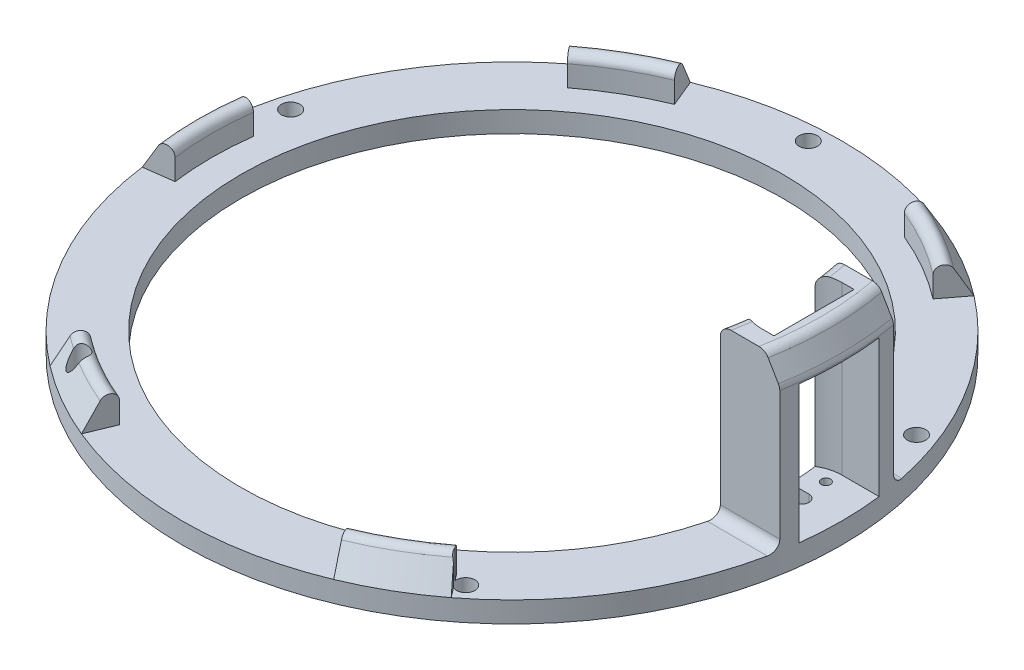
ISO-10303-21;
HEADER;
FILE_DESCRIPTION(('STEP AP214'),'2;1');
FILE_NAME('part.step','',(''),(''),'','','');
FILE_SCHEMA(('AUTOMOTIVE_DESIGN { 1 0 10303 214 1 1 1 1 }'));
ENDSEC;
DATA;
#1=APPLICATION_CONTEXT('core data for automotive mechanical design processes');
#2=APPLICATION_PROTOCOL_DEFINITION('international standard','automotive_design',2000,#1);
#3=PRODUCT_CONTEXT('',#1,'mechanical');
#4=PRODUCT('Part','Part','',(#3));
#5=PRODUCT_RELATED_PRODUCT_CATEGORY('part','',(#4));
#6=PRODUCT_DEFINITION_FORMATION('','',#4);
#7=PRODUCT_DEFINITION_CONTEXT('part definition',#1,'design');
#8=PRODUCT_DEFINITION('design','',#6,#7);
#9=PRODUCT_DEFINITION_SHAPE('','',#8);
#10=(LENGTH_UNIT() NAMED_UNIT(*) SI_UNIT(.MILLI.,.METRE.));
#11=(NAMED_UNIT(*) PLANE_ANGLE_UNIT() SI_UNIT($,.RADIAN.));
#12=(NAMED_UNIT(*) SI_UNIT($,.STERADIAN.) SOLID_ANGLE_UNIT());
#13=UNCERTAINTY_MEASURE_WITH_UNIT(LENGTH_MEASURE(1.E-05),#10,'distance_accuracy_value','');
#14=(GEOMETRIC_REPRESENTATION_CONTEXT(3) GLOBAL_UNCERTAINTY_ASSIGNED_CONTEXT((#13)) GLOBAL_UNIT_ASSIGNED_CONTEXT((#10,
#11,#12)) REPRESENTATION_CONTEXT('',''));
#15=CARTESIAN_POINT('',(0.,0.,0.));
#16=DIRECTION('',(0.,0.,1.));
#17=DIRECTION('',(1.,0.,0.));
#18=AXIS2_PLACEMENT_3D('',#15,#16,#17);
#19=CARTESIAN_POINT('',(57.1410177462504,12.7000000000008,74.4676241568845));
#20=DIRECTION('',(-0.793353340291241,0.,0.608761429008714));
#21=DIRECTION('',(0.608761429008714,0.,0.793353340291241));
#22=AXIS2_PLACEMENT_3D('',#19,#20,#21);
#23=PLANE('',#22);
#24=CARTESIAN_POINT('',(57.1410177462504,12.7000000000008,74.4676241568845));
#25=DIRECTION('',(0.793353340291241,0.,-0.608761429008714));
#26=DIRECTION('',(0.608761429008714,0.,0.793353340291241));
#27=AXIS2_PLACEMENT_3D('',#24,#25,#26);
#28=CIRCLE('',#27,2.42438598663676);
#29=CARTESIAN_POINT('',(55.6651450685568,12.7000000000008,72.5442294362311));
#30=VERTEX_POINT('',#29);
#31=CARTESIAN_POINT('',(57.228870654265,15.1200869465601,74.582116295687));
#32=VERTEX_POINT('',#31);
#33=EDGE_CURVE('E361',#30,#32,#28,.T.);
#34=ORIENTED_EDGE('',*,*,#33,.T.);
#35=DIRECTION('',(0.,-1.,0.));
#36=VECTOR('',#35,1.);
#37=CARTESIAN_POINT('',(57.228870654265,0.,74.582116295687));
#38=LINE('',#37,#36);
#39=CARTESIAN_POINT('',(57.228870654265,6.34999999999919,74.582116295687));
#40=VERTEX_POINT('',#39);
#41=EDGE_CURVE('E342',#32,#40,#38,.T.);
#42=ORIENTED_EDGE('',*,*,#41,.T.);
#43=DIRECTION('',(-0.608761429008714,1.83033815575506E-13,-0.793353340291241));
#44=VECTOR('',#43,1.);
#45=CARTESIAN_POINT('',(61.0770341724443,6.34999999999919,79.5971406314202));
#46=LINE('',#45,#44);
#47=CARTESIAN_POINT('',(55.6651450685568,6.35,72.5442294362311));
#48=VERTEX_POINT('',#47);
#49=EDGE_CURVE('E349',#40,#48,#46,.T.);
#50=ORIENTED_EDGE('',*,*,#49,.T.);
#51=DIRECTION('',(0.,1.,0.));
#52=VECTOR('',#51,1.);
#53=CARTESIAN_POINT('',(55.6651450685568,6.35000000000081,72.5442294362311));
#54=LINE('',#53,#52);
#55=EDGE_CURVE('E358',#48,#30,#54,.T.);
#56=ORIENTED_EDGE('',*,*,#55,.T.);
#57=EDGE_LOOP('',(#34,#42,#50,#56));
#58=FACE_BOUND('',#57,.T.);
#59=ADVANCED_FACE('F35',(#58),#23,.F.);
#60=CARTESIAN_POINT('',(0.,6.35,0.));
#61=DIRECTION('',(0.,1.,0.));
#62=DIRECTION('',(0.,0.,1.));
#63=AXIS2_PLACEMENT_3D('',#60,#61,#62);
#64=PLANE('',#63);
#65=CARTESIAN_POINT('',(-92.0780385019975,6.35,-24.6722360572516));
#66=DIRECTION('',(0.,1.,0.));
#67=DIRECTION('',(0.,0.,1.));
#68=AXIS2_PLACEMENT_3D('',#65,#66,#67);
#69=CIRCLE('',#68,2.8067);
#70=CARTESIAN_POINT('',(-92.0780385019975,6.35,-21.8655360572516));
#71=VERTEX_POINT('',#70);
#72=EDGE_CURVE('E40',#71,#71,#69,.T.);
#73=ORIENTED_EDGE('',*,*,#72,.F.);
#74=EDGE_LOOP('',(#73));
#75=FACE_BOUND('',#74,.T.);
#76=CARTESIAN_POINT('',(-4.9889878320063,6.35,-95.195558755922));
#77=DIRECTION('',(0.,1.,0.));
#78=DIRECTION('',(0.,0.,1.));
#79=AXIS2_PLACEMENT_3D('',#76,#77,#78);
#80=CIRCLE('',#79,2.80669999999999);
#81=CARTESIAN_POINT('',(-4.9889878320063,6.35,-92.388858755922));
#82=VERTEX_POINT('',#81);
#83=EDGE_CURVE('E1397',#82,#82,#80,.T.);
#84=ORIENTED_EDGE('',*,*,#83,.F.);
#85=EDGE_LOOP('',(#84));
#86=FACE_BOUND('',#85,.T.);
#87=CARTESIAN_POINT('',(88.9946744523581,6.35,-34.1618548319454));
#88=DIRECTION('',(0.,1.,0.));
#89=DIRECTION('',(0.,0.,1.));
#90=AXIS2_PLACEMENT_3D('',#87,#88,#89);
#91=CIRCLE('',#90,2.8067);
#92=CARTESIAN_POINT('',(88.9946744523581,6.35,-31.3551548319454));
#93=VERTEX_POINT('',#92);
#94=EDGE_CURVE('E1400',#93,#93,#91,.T.);
#95=ORIENTED_EDGE('',*,*,#94,.F.);
#96=EDGE_LOOP('',(#95));
#97=FACE_BOUND('',#96,.T.);
#98=CARTESIAN_POINT('',(59.9907214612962,6.35,74.0823713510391));
#99=DIRECTION('',(0.,1.,0.));
#100=DIRECTION('',(0.,0.,1.));
#101=AXIS2_PLACEMENT_3D('',#98,#99,#100);
#102=CIRCLE('',#101,2.80669999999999);
#103=CARTESIAN_POINT('',(58.7931853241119,6.34999999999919,76.6207708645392));
#104=VERTEX_POINT('',#103);
#105=EDGE_CURVE('E829',#104,#40,#102,.T.);
#106=ORIENTED_EDGE('',*,*,#105,.F.);
#107=CARTESIAN_POINT('',(61.0770341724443,6.34999999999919,79.5971406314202));
#108=VERTEX_POINT('',#107);
#109=EDGE_CURVE('E341',#108,#104,#46,.T.);
#110=ORIENTED_EDGE('',*,*,#109,.F.);
#111=CARTESIAN_POINT('',(0.,6.35,0.));
#112=DIRECTION('',(0.,1.,0.));
#113=DIRECTION('',(0.,0.,1.));
#114=AXIS2_PLACEMENT_3D('',#111,#112,#113);
#115=CIRCLE('',#114,100.33);
#116=CARTESIAN_POINT('',(98.2202158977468,6.35,20.4670000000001));
#117=VERTEX_POINT('',#116);
#118=EDGE_CURVE('E737',#108,#117,#115,.T.);
#119=ORIENTED_EDGE('',*,*,#118,.T.);
#120=DIRECTION('',(1.,0.,0.));
#121=VECTOR('',#120,1.);
#122=CARTESIAN_POINT('',(0.,6.35,20.4670000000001));
#123=LINE('',#122,#121);
#124=CARTESIAN_POINT('',(79.9725228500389,6.35,20.4670000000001));
#125=VERTEX_POINT('',#124);
#126=EDGE_CURVE('E592',#117,#125,#123,.F.);
#127=ORIENTED_EDGE('',*,*,#126,.T.);
#128=CARTESIAN_POINT('',(0.,6.35,0.));
#129=DIRECTION('',(0.,1.,0.));
#130=DIRECTION('',(0.,0.,1.));
#131=AXIS2_PLACEMENT_3D('',#128,#129,#130);
#132=CIRCLE('',#131,82.55);
#133=CARTESIAN_POINT('',(79.9725228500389,6.35,-20.4670000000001));
#134=VERTEX_POINT('',#133);
#135=EDGE_CURVE('E616',#134,#125,#132,.T.);
#136=ORIENTED_EDGE('',*,*,#135,.F.);
#137=DIRECTION('',(-1.,0.,0.));
#138=VECTOR('',#137,1.);
#139=CARTESIAN_POINT('',(0.,6.35,-20.4670000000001));
#140=LINE('',#139,#138);
#141=CARTESIAN_POINT('',(98.2202158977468,6.35,-20.4670000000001));
#142=VERTEX_POINT('',#141);
#143=EDGE_CURVE('E916',#134,#142,#140,.F.);
#144=ORIENTED_EDGE('',*,*,#143,.T.);
#145=CARTESIAN_POINT('',(61.0770341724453,6.35,-79.5971406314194));
#146=VERTEX_POINT('',#145);
#147=EDGE_CURVE('E594',#142,#146,#115,.T.);
#148=ORIENTED_EDGE('',*,*,#147,.T.);
#149=DIRECTION('',(-0.608761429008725,1.83033815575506E-13,0.793353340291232));
#150=VECTOR('',#149,1.);
#151=CARTESIAN_POINT('',(61.0770341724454,6.34999999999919,-79.5971406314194));
#152=LINE('',#151,#150);
#153=CARTESIAN_POINT('',(55.6651450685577,6.35,-72.5442294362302));
#154=VERTEX_POINT('',#153);
#155=EDGE_CURVE('E375',#146,#154,#152,.T.);
#156=ORIENTED_EDGE('',*,*,#155,.T.);
#157=CARTESIAN_POINT('',(0.,6.35000000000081,0.));
#158=DIRECTION('',(0.,-1.,0.));
#159=DIRECTION('',(0.866025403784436,0.,0.500000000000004));
#160=AXIS2_PLACEMENT_3D('',#157,#158,#159);
#161=CIRCLE('',#160,91.4400000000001);
#162=CARTESIAN_POINT('',(34.9925730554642,6.35,-84.479544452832));
#163=VERTEX_POINT('',#162);
#164=EDGE_CURVE('E397',#163,#154,#161,.T.);
#165=ORIENTED_EDGE('',*,*,#164,.F.);
#166=DIRECTION('',(-0.382683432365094,1.83033815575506E-13,0.923879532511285));
#167=VECTOR('',#166,1.);
#168=CARTESIAN_POINT('',(38.3946287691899,6.34999999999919,-92.6928334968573));
#169=LINE('',#168,#167);
#170=CARTESIAN_POINT('',(38.3946287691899,6.34999999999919,-92.6928334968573));
#171=VERTEX_POINT('',#170);
#172=EDGE_CURVE('E386',#171,#163,#169,.T.);
#173=ORIENTED_EDGE('',*,*,#172,.F.);
#174=CARTESIAN_POINT('',(-38.3946287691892,6.35,-92.6928334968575));
#175=VERTEX_POINT('',#174);
#176=EDGE_CURVE('E735',#171,#175,#115,.T.);
#177=ORIENTED_EDGE('',*,*,#176,.T.);
#178=DIRECTION('',(0.382683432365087,1.83033815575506E-13,0.923879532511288));
#179=VECTOR('',#178,1.);
#180=CARTESIAN_POINT('',(-38.3946287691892,6.34999999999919,-92.6928334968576));
#181=LINE('',#180,#179);
#182=CARTESIAN_POINT('',(-34.9925730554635,6.35,-84.479544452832));
#183=VERTEX_POINT('',#182);
#184=EDGE_CURVE('E407',#175,#183,#181,.T.);
#185=ORIENTED_EDGE('',*,*,#184,.T.);
#186=CARTESIAN_POINT('',(0.,6.35000000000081,0.));
#187=DIRECTION('',(0.,-1.,0.));
#188=DIRECTION('',(0.86602540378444,0.,-0.499999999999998));
#189=AXIS2_PLACEMENT_3D('',#186,#187,#188);
#190=CIRCLE('',#189,91.4400000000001);
#191=CARTESIAN_POINT('',(-55.6651450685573,6.35,-72.5442294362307));
#192=VERTEX_POINT('',#191);
#193=EDGE_CURVE('E430',#192,#183,#190,.T.);
#194=ORIENTED_EDGE('',*,*,#193,.F.);
#195=DIRECTION('',(0.608761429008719,1.83033815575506E-13,0.793353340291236));
#196=VECTOR('',#195,1.);
#197=CARTESIAN_POINT('',(-61.0770341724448,6.34999999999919,-79.5971406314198));
#198=LINE('',#197,#196);
#199=CARTESIAN_POINT('',(-61.0770341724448,6.34999999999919,-79.5971406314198));
#200=VERTEX_POINT('',#199);
#201=EDGE_CURVE('E418',#200,#192,#198,.T.);
#202=ORIENTED_EDGE('',*,*,#201,.F.);
#203=CARTESIAN_POINT('',(-99.4716629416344,6.35,-13.0956928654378));
#204=VERTEX_POINT('',#203);
#205=EDGE_CURVE('E718',#200,#204,#115,.T.);
#206=ORIENTED_EDGE('',*,*,#205,.T.);
#207=DIRECTION('',(0.99144486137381,1.83033815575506E-13,0.130526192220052));
#208=VECTOR('',#207,1.);
#209=CARTESIAN_POINT('',(-99.4716629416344,6.34999999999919,-13.0956928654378));
#210=LINE('',#209,#208);
#211=CARTESIAN_POINT('',(-90.6577181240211,6.35,-11.9353150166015));
#212=VERTEX_POINT('',#211);
#213=EDGE_CURVE('E440',#204,#212,#210,.T.);
#214=ORIENTED_EDGE('',*,*,#213,.T.);
#215=CARTESIAN_POINT('',(0.,6.35000000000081,0.));
#216=DIRECTION('',(0.,-1.,0.));
#217=DIRECTION('',(0.,0.,-1.));
#218=AXIS2_PLACEMENT_3D('',#215,#216,#217);
#219=CIRCLE('',#218,91.4400000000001);
#220=CARTESIAN_POINT('',(-90.6577181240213,6.35,11.9353150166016));
#221=VERTEX_POINT('',#220);
#222=EDGE_CURVE('E463',#221,#212,#219,.T.);
#223=ORIENTED_EDGE('',*,*,#222,.F.);
#224=DIRECTION('',(0.99144486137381,1.83033815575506E-13,-0.130526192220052));
#225=VECTOR('',#224,1.);
#226=CARTESIAN_POINT('',(-99.4716629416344,6.34999999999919,13.0956928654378));
#227=LINE('',#226,#225);
#228=CARTESIAN_POINT('',(-99.4716629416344,6.34999999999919,13.0956928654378));
#229=VERTEX_POINT('',#228);
#230=EDGE_CURVE('E451',#229,#221,#227,.T.);
#231=ORIENTED_EDGE('',*,*,#230,.F.);
#232=CARTESIAN_POINT('',(-61.0770341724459,6.35,79.5971406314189));
#233=VERTEX_POINT('',#232);
#234=EDGE_CURVE('E715',#229,#233,#115,.T.);
#235=ORIENTED_EDGE('',*,*,#234,.T.);
#236=DIRECTION('',(0.60876142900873,1.83033815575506E-13,-0.793353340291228));
#237=VECTOR('',#236,1.);
#238=CARTESIAN_POINT('',(-61.0770341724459,6.34999999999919,79.5971406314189));
#239=LINE('',#238,#237);
#240=CARTESIAN_POINT('',(-55.6651450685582,6.35,72.5442294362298));
#241=VERTEX_POINT('',#240);
#242=EDGE_CURVE('E1423',#233,#241,#239,.T.);
#243=ORIENTED_EDGE('',*,*,#242,.T.);
#244=CARTESIAN_POINT('',(0.,6.35000000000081,0.));
#245=DIRECTION('',(0.,-1.,0.));
#246=DIRECTION('',(-0.866025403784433,0.,-0.50000000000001));
#247=AXIS2_PLACEMENT_3D('',#244,#245,#246);
#248=CIRCLE('',#247,91.4400000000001);
#249=CARTESIAN_POINT('',(-34.9925730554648,6.35,84.4795444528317));
#250=VERTEX_POINT('',#249);
#251=EDGE_CURVE('E1444',#250,#241,#248,.T.);
#252=ORIENTED_EDGE('',*,*,#251,.F.);
#253=DIRECTION('',(0.3826834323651,1.83033815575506E-13,-0.923879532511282));
#254=VECTOR('',#253,1.);
#255=CARTESIAN_POINT('',(-38.3946287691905,6.34999999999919,92.692833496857));
#256=LINE('',#255,#254);
#257=CARTESIAN_POINT('',(-38.3946287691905,6.34999999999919,92.692833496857));
#258=VERTEX_POINT('',#257);
#259=EDGE_CURVE('E1433',#258,#250,#256,.T.);
#260=ORIENTED_EDGE('',*,*,#259,.F.);
#261=CARTESIAN_POINT('',(38.3946287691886,6.35,92.6928334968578));
#262=VERTEX_POINT('',#261);
#263=EDGE_CURVE('E719',#258,#262,#115,.T.);
#264=ORIENTED_EDGE('',*,*,#263,.T.);
#265=DIRECTION('',(-0.382683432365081,1.83033815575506E-13,-0.92387953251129));
#266=VECTOR('',#265,1.);
#267=CARTESIAN_POINT('',(38.3946287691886,6.34999999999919,92.6928334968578));
#268=LINE('',#267,#266);
#269=CARTESIAN_POINT('',(34.9925730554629,6.35,84.4795444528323));
#270=VERTEX_POINT('',#269);
#271=EDGE_CURVE('E1454',#262,#270,#268,.T.);
#272=ORIENTED_EDGE('',*,*,#271,.T.);
#273=CARTESIAN_POINT('',(0.,6.35000000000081,0.));
#274=DIRECTION('',(0.,-1.,0.));
#275=DIRECTION('',(-0.866025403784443,0.,0.499999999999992));
#276=AXIS2_PLACEMENT_3D('',#273,#274,#275);
#277=CIRCLE('',#276,91.4400000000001);
#278=EDGE_CURVE('E365',#48,#270,#277,.T.);
#279=ORIENTED_EDGE('',*,*,#278,.F.);
#280=ORIENTED_EDGE('',*,*,#49,.F.);
#281=EDGE_LOOP('',(#106,#110,#119,#127,#136,#144,#148,#156,#165,#173,#177,#185,#194,#202,#206,
#214,#223,#231,#235,#243,#252,#260,#264,#272,#279,#280));
#282=FACE_BOUND('',#281,.T.);
#283=ADVANCED_FACE('F793',(#75,#86,#97,#282),#64,.T.);
#284=CARTESIAN_POINT('',(87.565,6.35,7.999984));
#285=DIRECTION('',(0.,-1.,0.));
#286=DIRECTION('',(0.,0.,-1.));
#287=AXIS2_PLACEMENT_3D('',#284,#285,#286);
#288=CIRCLE('',#287,1.42239999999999);
#289=CARTESIAN_POINT('',(87.565,6.35,6.57758400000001));
#290=VERTEX_POINT('',#289);
#291=EDGE_CURVE('E872',#290,#290,#288,.T.);
#292=ORIENTED_EDGE('',*,*,#291,.T.);
#293=EDGE_LOOP('',(#292));
#294=FACE_BOUND('',#293,.T.);
#295=CARTESIAN_POINT('',(87.565,6.35,-7.999984));
#296=DIRECTION('',(0.,-1.,0.));
#297=DIRECTION('',(0.,0.,-1.));
#298=AXIS2_PLACEMENT_3D('',#295,#296,#297);
#299=CIRCLE('',#298,1.42239999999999);
#300=CARTESIAN_POINT('',(87.565,6.35,-9.42238399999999));
#301=VERTEX_POINT('',#300);
#302=EDGE_CURVE('E868',#301,#301,#299,.T.);
#303=ORIENTED_EDGE('',*,*,#302,.T.);
#304=EDGE_LOOP('',(#303));
#305=FACE_BOUND('',#304,.T.);
#306=DIRECTION('',(1.,0.,0.));
#307=VECTOR('',#306,1.);
#308=CARTESIAN_POINT('',(99.5840145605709,6.35,-12.2120000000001));
#309=LINE('',#308,#307);
#310=CARTESIAN_POINT('',(88.265,6.35,-12.2120000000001));
#311=VERTEX_POINT('',#310);
#312=CARTESIAN_POINT('',(99.5840145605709,6.35,-12.2120000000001));
#313=VERTEX_POINT('',#312);
#314=EDGE_CURVE('E493',#311,#313,#309,.T.);
#315=ORIENTED_EDGE('',*,*,#314,.F.);
#316=CARTESIAN_POINT('',(88.265,6.35,0.));
#317=DIRECTION('',(0.,-1.,0.));
#318=DIRECTION('',(0.,0.,-1.));
#319=AXIS2_PLACEMENT_3D('',#316,#317,#318);
#320=CIRCLE('',#319,12.2120000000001);
#321=CARTESIAN_POINT('',(81.8902157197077,6.35,-10.4160966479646));
#322=VERTEX_POINT('',#321);
#323=EDGE_CURVE('E487',#322,#311,#320,.T.);
#324=ORIENTED_EDGE('',*,*,#323,.F.);
#325=CARTESIAN_POINT('',(82.5211339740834,6.35,-2.1828760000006));
#326=VERTEX_POINT('',#325);
#327=EDGE_CURVE('E854',#326,#322,#132,.T.);
#328=ORIENTED_EDGE('',*,*,#327,.F.);
#329=DIRECTION('',(-1.,0.,0.));
#330=VECTOR('',#329,1.);
#331=CARTESIAN_POINT('',(88.265,6.35,-2.18287600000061));
#332=LINE('',#331,#330);
#333=CARTESIAN_POINT('',(88.265,6.35,-2.18287600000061));
#334=VERTEX_POINT('',#333);
#335=EDGE_CURVE('E890',#334,#326,#332,.T.);
#336=ORIENTED_EDGE('',*,*,#335,.F.);
#337=CARTESIAN_POINT('',(88.265,6.35,6.05541855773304E-13));
#338=DIRECTION('',(0.,-1.,0.));
#339=DIRECTION('',(0.,0.,-1.));
#340=AXIS2_PLACEMENT_3D('',#337,#338,#339);
#341=CIRCLE('',#340,2.182876);
#342=CARTESIAN_POINT('',(88.265,6.35,2.18287600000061));
#343=VERTEX_POINT('',#342);
#344=EDGE_CURVE('E860',#334,#343,#341,.T.);
#345=ORIENTED_EDGE('',*,*,#344,.T.);
#346=DIRECTION('',(1.,0.,0.));
#347=VECTOR('',#346,1.);
#348=CARTESIAN_POINT('',(88.265,6.35,2.18287600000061));
#349=LINE('',#348,#347);
#350=CARTESIAN_POINT('',(82.5211339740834,6.35,2.1828760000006));
#351=VERTEX_POINT('',#350);
#352=EDGE_CURVE('E887',#351,#343,#349,.T.);
#353=ORIENTED_EDGE('',*,*,#352,.F.);
#354=CARTESIAN_POINT('',(81.8902157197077,6.35,10.4160966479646));
#355=VERTEX_POINT('',#354);
#356=EDGE_CURVE('E724',#355,#351,#132,.T.);
#357=ORIENTED_EDGE('',*,*,#356,.F.);
#358=CARTESIAN_POINT('',(88.265,6.35,0.));
#359=DIRECTION('',(0.,-1.,0.));
#360=DIRECTION('',(0.,0.,1.));
#361=AXIS2_PLACEMENT_3D('',#358,#359,#360);
#362=CIRCLE('',#361,12.2120000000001);
#363=CARTESIAN_POINT('',(88.265,6.35,12.2120000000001));
#364=VERTEX_POINT('',#363);
#365=EDGE_CURVE('E519',#364,#355,#362,.T.);
#366=ORIENTED_EDGE('',*,*,#365,.F.);
#367=DIRECTION('',(-1.,0.,0.));
#368=VECTOR('',#367,1.);
#369=CARTESIAN_POINT('',(99.5840145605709,6.35,12.2120000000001));
#370=LINE('',#369,#368);
#371=CARTESIAN_POINT('',(99.5840145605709,6.35,12.2120000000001));
#372=VERTEX_POINT('',#371);
#373=EDGE_CURVE('E515',#372,#364,#370,.T.);
#374=ORIENTED_EDGE('',*,*,#373,.F.);
#375=EDGE_CURVE('E726',#372,#313,#115,.T.);
#376=ORIENTED_EDGE('',*,*,#375,.T.);
#377=EDGE_LOOP('',(#315,#324,#328,#336,#345,#353,#357,#366,#374,#376));
#378=FACE_BOUND('',#377,.T.);
#379=ADVANCED_FACE('F702',(#294,#305,#378),#64,.T.);
#380=CARTESIAN_POINT('',(0.,0.,0.));
#381=DIRECTION('',(0.,1.,0.));
#382=DIRECTION('',(0.,0.,1.));
#383=AXIS2_PLACEMENT_3D('',#380,#381,#382);
#384=PLANE('',#383);
#385=CARTESIAN_POINT('',(-92.0780385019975,0.,-24.6722360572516));
#386=DIRECTION('',(0.,-1.,0.));
#387=DIRECTION('',(0.,0.,-1.));
#388=AXIS2_PLACEMENT_3D('',#385,#386,#387);
#389=CIRCLE('',#388,2.8067);
#390=CARTESIAN_POINT('',(-92.0780385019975,0.,-27.4789360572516));
#391=VERTEX_POINT('',#390);
#392=EDGE_CURVE('E1392',#391,#391,#389,.T.);
#393=ORIENTED_EDGE('',*,*,#392,.F.);
#394=EDGE_LOOP('',(#393));
#395=FACE_BOUND('',#394,.T.);
#396=CARTESIAN_POINT('',(-4.9889878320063,0.,-95.195558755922));
#397=DIRECTION('',(0.,-1.,0.));
#398=DIRECTION('',(0.,0.,-1.));
#399=AXIS2_PLACEMENT_3D('',#396,#397,#398);
#400=CIRCLE('',#399,2.80669999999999);
#401=CARTESIAN_POINT('',(-4.9889878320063,0.,-98.002258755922));
#402=VERTEX_POINT('',#401);
#403=EDGE_CURVE('E1394',#402,#402,#400,.T.);
#404=ORIENTED_EDGE('',*,*,#403,.F.);
#405=EDGE_LOOP('',(#404));
#406=FACE_BOUND('',#405,.T.);
#407=CARTESIAN_POINT('',(88.9946744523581,0.,-34.1618548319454));
#408=DIRECTION('',(0.,-1.,0.));
#409=DIRECTION('',(0.,0.,-1.));
#410=AXIS2_PLACEMENT_3D('',#407,#408,#409);
#411=CIRCLE('',#410,2.8067);
#412=CARTESIAN_POINT('',(88.9946744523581,0.,-36.9685548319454));
#413=VERTEX_POINT('',#412);
#414=EDGE_CURVE('E1398',#413,#413,#411,.T.);
#415=ORIENTED_EDGE('',*,*,#414,.F.);
#416=EDGE_LOOP('',(#415));
#417=FACE_BOUND('',#416,.T.);
#418=CARTESIAN_POINT('',(59.9907214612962,0.,74.0823713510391));
#419=DIRECTION('',(0.,-1.,0.));
#420=DIRECTION('',(0.,0.,-1.));
#421=AXIS2_PLACEMENT_3D('',#418,#419,#420);
#422=CIRCLE('',#421,2.80669999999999);
#423=CARTESIAN_POINT('',(59.9907214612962,0.,71.2756713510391));
#424=VERTEX_POINT('',#423);
#425=EDGE_CURVE('E825',#424,#424,#422,.T.);
#426=ORIENTED_EDGE('',*,*,#425,.F.);
#427=EDGE_LOOP('',(#426));
#428=FACE_BOUND('',#427,.T.);
#429=CARTESIAN_POINT('',(-51.918369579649,0.,79.9472782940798));
#430=DIRECTION('',(0.,-1.,0.));
#431=DIRECTION('',(0.,0.,-1.));
#432=AXIS2_PLACEMENT_3D('',#429,#430,#431);
#433=CIRCLE('',#432,2.80669999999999);
#434=CARTESIAN_POINT('',(-51.918369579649,0.,77.1405782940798));
#435=VERTEX_POINT('',#434);
#436=EDGE_CURVE('E773',#435,#435,#433,.T.);
#437=ORIENTED_EDGE('',*,*,#436,.F.);
#438=EDGE_LOOP('',(#437));
#439=FACE_BOUND('',#438,.T.);
#440=CARTESIAN_POINT('',(87.565,0.,7.999984));
#441=DIRECTION('',(0.,-1.,0.));
#442=DIRECTION('',(0.,0.,-1.));
#443=AXIS2_PLACEMENT_3D('',#440,#441,#442);
#444=CIRCLE('',#443,1.4224);
#445=CARTESIAN_POINT('',(87.565,0.,6.577584));
#446=VERTEX_POINT('',#445);
#447=EDGE_CURVE('E840',#446,#446,#444,.T.);
#448=ORIENTED_EDGE('',*,*,#447,.F.);
#449=EDGE_LOOP('',(#448));
#450=FACE_BOUND('',#449,.T.);
#451=CARTESIAN_POINT('',(87.565,0.,-7.999984));
#452=DIRECTION('',(0.,-1.,0.));
#453=DIRECTION('',(0.,0.,-1.));
#454=AXIS2_PLACEMENT_3D('',#451,#452,#453);
#455=CIRCLE('',#454,1.4224);
#456=CARTESIAN_POINT('',(87.565,0.,-9.42238400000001));
#457=VERTEX_POINT('',#456);
#458=EDGE_CURVE('E844',#457,#457,#455,.T.);
#459=ORIENTED_EDGE('',*,*,#458,.F.);
#460=EDGE_LOOP('',(#459));
#461=FACE_BOUND('',#460,.T.);
#462=CARTESIAN_POINT('',(0.,0.,0.));
#463=DIRECTION('',(0.,1.,0.));
#464=DIRECTION('',(0.,0.,1.));
#465=AXIS2_PLACEMENT_3D('',#462,#463,#464);
#466=CIRCLE('',#465,82.55);
#467=CARTESIAN_POINT('',(82.5211339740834,0.,-2.1828760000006));
#468=VERTEX_POINT('',#467);
#469=CARTESIAN_POINT('',(82.5211339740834,0.,2.1828760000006));
#470=VERTEX_POINT('',#469);
#471=EDGE_CURVE('E850',#468,#470,#466,.T.);
#472=ORIENTED_EDGE('',*,*,#471,.T.);
#473=DIRECTION('',(1.,0.,0.));
#474=VECTOR('',#473,1.);
#475=CARTESIAN_POINT('',(88.265,0.,2.18287600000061));
#476=LINE('',#475,#474);
#477=CARTESIAN_POINT('',(88.265,0.,2.18287600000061));
#478=VERTEX_POINT('',#477);
#479=EDGE_CURVE('E884',#470,#478,#476,.T.);
#480=ORIENTED_EDGE('',*,*,#479,.T.);
#481=CARTESIAN_POINT('',(88.265,0.,6.05541855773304E-13));
#482=DIRECTION('',(0.,-1.,0.));
#483=DIRECTION('',(0.,0.,-1.));
#484=AXIS2_PLACEMENT_3D('',#481,#482,#483);
#485=CIRCLE('',#484,2.18287599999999);
#486=CARTESIAN_POINT('',(88.265,0.,-2.18287599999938));
#487=VERTEX_POINT('',#486);
#488=EDGE_CURVE('E865',#487,#478,#485,.T.);
#489=ORIENTED_EDGE('',*,*,#488,.F.);
#490=DIRECTION('',(-1.,0.,0.));
#491=VECTOR('',#490,1.);
#492=CARTESIAN_POINT('',(88.265,0.,-2.18287600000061));
#493=LINE('',#492,#491);
#494=EDGE_CURVE('E889',#487,#468,#493,.T.);
#495=ORIENTED_EDGE('',*,*,#494,.T.);
#496=EDGE_LOOP('',(#472,#480,#489,#495));
#497=FACE_BOUND('',#496,.T.);
#498=CARTESIAN_POINT('',(0.,0.,0.));
#499=DIRECTION('',(0.,1.,0.));
#500=DIRECTION('',(0.,0.,1.));
#501=AXIS2_PLACEMENT_3D('',#498,#499,#500);
#502=CIRCLE('',#501,100.33);
#503=CARTESIAN_POINT('',(0.,0.,100.33));
#504=VERTEX_POINT('',#503);
#505=EDGE_CURVE('E738',#504,#504,#502,.T.);
#506=ORIENTED_EDGE('',*,*,#505,.F.);
#507=EDGE_LOOP('',(#506));
#508=FACE_BOUND('',#507,.T.);
#509=ADVANCED_FACE('F833',(#395,#406,#417,#428,#439,#450,#461,#497,#508),#384,.F.);
#510=CARTESIAN_POINT('',(0.,6.35,0.));
#511=DIRECTION('',(0.,-1.,0.));
#512=DIRECTION('',(0.,0.,-1.));
#513=AXIS2_PLACEMENT_3D('',#510,#511,#512);
#514=CYLINDRICAL_SURFACE('',#513,100.33);
#515=DIRECTION('',(0.,-1.,0.));
#516=VECTOR('',#515,1.);
#517=CARTESIAN_POINT('',(99.5840145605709,57.15,12.2120000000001));
#518=LINE('',#517,#516);
#519=CARTESIAN_POINT('',(99.5840145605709,48.26,12.2120000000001));
#520=VERTEX_POINT('',#519);
#521=EDGE_CURVE('E538',#520,#372,#518,.T.);
#522=ORIENTED_EDGE('',*,*,#521,.F.);
#523=CARTESIAN_POINT('',(0.,48.26,0.));
#524=DIRECTION('',(0.,1.,0.));
#525=DIRECTION('',(0.,0.,1.));
#526=AXIS2_PLACEMENT_3D('',#523,#524,#525);
#527=CIRCLE('',#526,100.33);
#528=CARTESIAN_POINT('',(99.5840145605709,48.26,-12.2120000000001));
#529=VERTEX_POINT('',#528);
#530=EDGE_CURVE('E471',#520,#529,#527,.T.);
#531=ORIENTED_EDGE('',*,*,#530,.T.);
#532=DIRECTION('',(0.,-1.,0.));
#533=VECTOR('',#532,1.);
#534=CARTESIAN_POINT('',(99.5840145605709,57.15,-12.2120000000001));
#535=LINE('',#534,#533);
#536=EDGE_CURVE('E508',#529,#313,#535,.T.);
#537=ORIENTED_EDGE('',*,*,#536,.T.);
#538=ORIENTED_EDGE('',*,*,#375,.F.);
#539=EDGE_LOOP('',(#522,#531,#537,#538));
#540=FACE_BOUND('',#539,.T.);
#541=DIRECTION('',(0.,-1.,0.));
#542=VECTOR('',#541,1.);
#543=CARTESIAN_POINT('',(98.8286174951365,57.15,-17.2920000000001));
#544=LINE('',#543,#542);
#545=CARTESIAN_POINT('',(98.8286174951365,48.6792613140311,-17.2920000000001));
#546=VERTEX_POINT('',#545);
#547=CARTESIAN_POINT('',(98.8286174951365,9.525,-17.2920000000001));
#548=VERTEX_POINT('',#547);
#549=EDGE_CURVE('E505',#546,#548,#544,.T.);
#550=ORIENTED_EDGE('',*,*,#549,.F.);
#551=CARTESIAN_POINT('',(0.,48.6792613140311,0.));
#552=DIRECTION('',(0.,1.,0.));
#553=DIRECTION('',(0.,0.,1.));
#554=AXIS2_PLACEMENT_3D('',#551,#552,#553);
#555=CIRCLE('',#554,100.33);
#556=CARTESIAN_POINT('',(98.8286174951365,48.6792613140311,17.2920000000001));
#557=VERTEX_POINT('',#556);
#558=EDGE_CURVE('E675',#546,#557,#555,.F.);
#559=ORIENTED_EDGE('',*,*,#558,.T.);
#560=DIRECTION('',(0.,-1.,0.));
#561=VECTOR('',#560,1.);
#562=CARTESIAN_POINT('',(98.8286174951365,57.15,17.2920000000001));
#563=LINE('',#562,#561);
#564=CARTESIAN_POINT('',(98.8286174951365,9.525,17.2920000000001));
#565=VERTEX_POINT('',#564);
#566=EDGE_CURVE('E525',#557,#565,#563,.T.);
#567=ORIENTED_EDGE('',*,*,#566,.T.);
#568=CARTESIAN_POINT('',(98.8286174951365,9.525,17.2920000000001));
#569=CARTESIAN_POINT('',(98.8286182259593,9.43672191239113,17.2919907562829));
#570=CARTESIAN_POINT('',(98.8279732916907,9.34844820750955,17.2956816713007));
#571=CARTESIAN_POINT('',(98.825398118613,9.17253873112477,17.3103925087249));
#572=CARTESIAN_POINT('',(98.8234679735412,9.0849029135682,17.321411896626));
#573=CARTESIAN_POINT('',(98.8183312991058,8.91098338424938,17.350691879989));
#574=CARTESIAN_POINT('',(98.8151262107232,8.82469825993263,17.3689443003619));
#575=CARTESIAN_POINT('',(98.8074550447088,8.65401829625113,17.4125303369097));
#576=CARTESIAN_POINT('',(98.8029889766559,8.56962344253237,17.4378638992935));
#577=CARTESIAN_POINT('',(98.7877167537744,8.3201066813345,17.5242515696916));
#578=CARTESIAN_POINT('',(98.77503384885,8.15855970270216,17.5957084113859));
#579=CARTESIAN_POINT('',(98.7448922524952,7.84995597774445,17.764076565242));
#580=CARTESIAN_POINT('',(98.7274339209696,7.70289814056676,17.8609859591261));
#581=CARTESIAN_POINT('',(98.6879252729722,7.42632991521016,18.0780117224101));
#582=CARTESIAN_POINT('',(98.6658490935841,7.29692544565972,18.1982585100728));
#583=CARTESIAN_POINT('',(98.6175770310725,7.0601112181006,18.458055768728));
#584=CARTESIAN_POINT('',(98.5913803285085,6.9527058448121,18.5976100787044));
#585=CARTESIAN_POINT('',(98.5349882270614,6.76125259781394,18.8941279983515));
#586=CARTESIAN_POINT('',(98.5047402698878,6.67756668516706,19.0513150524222));
#587=CARTESIAN_POINT('',(98.4412099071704,6.53774560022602,19.3769077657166));
#588=CARTESIAN_POINT('',(98.4079283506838,6.48160274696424,19.5453102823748));
#589=CARTESIAN_POINT('',(98.3488970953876,6.40998509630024,19.8398353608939));
#590=CARTESIAN_POINT('',(98.3236868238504,6.38749339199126,19.9644103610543));
#591=CARTESIAN_POINT('',(98.2724753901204,6.35750171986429,20.214994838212));
#592=CARTESIAN_POINT('',(98.2464754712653,6.34997931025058,20.3410018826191));
#593=CARTESIAN_POINT('',(98.2202158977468,6.35,20.4670000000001));
#594=B_SPLINE_CURVE_WITH_KNOTS('',3,(#568,#569,#570,#571,#572,#573,#574,#575,#576,#577,#578,
#579,#580,#581,#582,#583,#584,#585,#586,#587,#588,#589,#590,#591,#592,#593),.UNSPECIFIED.,.F.,
.F.,(4,2,2,2,2,2,2,2,2,2,2,2,4),(0.,0.264746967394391,0.52947462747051,0.793903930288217,
1.05833122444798,1.58690666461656,2.11544227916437,2.64702133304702,3.17870623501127,
3.71811453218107,4.25737231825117,4.64376025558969,5.02956848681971),.UNSPECIFIED.);
#595=EDGE_CURVE('E711',#565,#117,#594,.T.);
#596=ORIENTED_EDGE('',*,*,#595,.T.);
#597=ORIENTED_EDGE('',*,*,#118,.F.);
#598=CARTESIAN_POINT('',(0.,6.34999999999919,0.));
#599=DIRECTION('',(0.,-1.,0.));
#600=DIRECTION('',(-0.866025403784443,0.,0.499999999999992));
#601=AXIS2_PLACEMENT_3D('',#598,#599,#600);
#602=CIRCLE('',#601,100.33);
#603=EDGE_CURVE('E348',#108,#262,#602,.T.);
#604=ORIENTED_EDGE('',*,*,#603,.T.);
#605=ORIENTED_EDGE('',*,*,#263,.F.);
#606=CARTESIAN_POINT('',(0.,6.34999999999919,0.));
#607=DIRECTION('',(0.,-1.,0.));
#608=DIRECTION('',(-0.866025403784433,0.,-0.50000000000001));
#609=AXIS2_PLACEMENT_3D('',#606,#607,#608);
#610=CIRCLE('',#609,100.33);
#611=EDGE_CURVE('E1442',#258,#233,#610,.T.);
#612=ORIENTED_EDGE('',*,*,#611,.T.);
#613=ORIENTED_EDGE('',*,*,#234,.F.);
#614=CARTESIAN_POINT('',(0.,6.34999999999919,0.));
#615=DIRECTION('',(0.,-1.,0.));
#616=DIRECTION('',(0.,0.,-1.));
#617=AXIS2_PLACEMENT_3D('',#614,#615,#616);
#618=CIRCLE('',#617,100.33);
#619=EDGE_CURVE('E460',#229,#204,#618,.T.);
#620=ORIENTED_EDGE('',*,*,#619,.T.);
#621=ORIENTED_EDGE('',*,*,#205,.F.);
#622=CARTESIAN_POINT('',(0.,6.34999999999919,0.));
#623=DIRECTION('',(0.,-1.,0.));
#624=DIRECTION('',(0.86602540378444,0.,-0.499999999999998));
#625=AXIS2_PLACEMENT_3D('',#622,#623,#624);
#626=CIRCLE('',#625,100.33);
#627=EDGE_CURVE('E427',#200,#175,#626,.T.);
#628=ORIENTED_EDGE('',*,*,#627,.T.);
#629=ORIENTED_EDGE('',*,*,#176,.F.);
#630=CARTESIAN_POINT('',(0.,6.34999999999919,0.));
#631=DIRECTION('',(0.,-1.,0.));
#632=DIRECTION('',(0.866025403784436,0.,0.500000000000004));
#633=AXIS2_PLACEMENT_3D('',#630,#631,#632);
#634=CIRCLE('',#633,100.33);
#635=EDGE_CURVE('E395',#171,#146,#634,.T.);
#636=ORIENTED_EDGE('',*,*,#635,.T.);
#637=ORIENTED_EDGE('',*,*,#147,.F.);
#638=CARTESIAN_POINT('',(98.2202158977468,6.35,-20.4670000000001));
#639=CARTESIAN_POINT('',(98.2390339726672,6.34999240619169,-20.3766988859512));
#640=CARTESIAN_POINT('',(98.2577246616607,6.35385248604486,-20.2863736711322));
#641=CARTESIAN_POINT('',(98.2947297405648,6.36926295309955,-20.1063022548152));
#642=CARTESIAN_POINT('',(98.3130441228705,6.38081349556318,-20.0165560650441));
#643=CARTESIAN_POINT('',(98.3491731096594,6.41155883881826,-19.8382794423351));
#644=CARTESIAN_POINT('',(98.3669877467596,6.43075313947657,-19.749748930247));
#645=CARTESIAN_POINT('',(98.4019989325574,6.47665757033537,-19.5745626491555));
#646=CARTESIAN_POINT('',(98.4191954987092,6.50336748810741,-19.4879068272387));
#647=CARTESIAN_POINT('',(98.4697255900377,6.59462208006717,-19.2315430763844));
#648=CARTESIAN_POINT('',(98.5020016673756,6.6702934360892,-19.0654281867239));
#649=CARTESIAN_POINT('',(98.5628652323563,6.84924033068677,-18.7482443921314));
#650=CARTESIAN_POINT('',(98.5914542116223,6.9525046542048,-18.597169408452));
#651=CARTESIAN_POINT('',(98.6440344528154,7.18250613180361,-18.3162104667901));
#652=CARTESIAN_POINT('',(98.6680765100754,7.30894846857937,-18.1860951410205));
#653=CARTESIAN_POINT('',(98.7114941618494,7.58263533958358,-17.9489388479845));
#654=CARTESIAN_POINT('',(98.7308689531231,7.72988344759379,-17.8419018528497));
#655=CARTESIAN_POINT('',(98.7642908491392,8.03822718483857,-17.6559495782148));
#656=CARTESIAN_POINT('',(98.7784235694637,8.19904224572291,-17.5765837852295));
#657=CARTESIAN_POINT('',(98.8015723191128,8.53199987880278,-17.4459921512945));
#658=CARTESIAN_POINT('',(98.8105925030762,8.70413312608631,-17.3947434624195));
#659=CARTESIAN_POINT('',(98.8208599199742,8.98547716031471,-17.3362923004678));
#660=CARTESIAN_POINT('',(98.8237693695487,9.09276562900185,-17.3196916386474));
#661=CARTESIAN_POINT('',(98.8276466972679,9.30835287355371,-17.2975486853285));
#662=CARTESIAN_POINT('',(98.8286174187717,9.41664993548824,-17.2919901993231));
#663=CARTESIAN_POINT('',(98.8286174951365,9.525,-17.2920000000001));
#664=B_SPLINE_CURVE_WITH_KNOTS('',3,(#638,#639,#640,#641,#642,#643,#644,#645,#646,#647,#648,
#649,#650,#651,#652,#653,#654,#655,#656,#657,#658,#659,#660,#661,#662,#663),.UNSPECIFIED.,.F.,
.F.,(4,2,2,2,2,2,2,2,2,2,2,2,4),(0.,0.276637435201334,0.553280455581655,0.829905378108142,
1.10652248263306,1.65972397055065,2.21270095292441,2.75907901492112,3.30555104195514,
3.84265759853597,4.37932705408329,4.70460417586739,5.02940389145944),.UNSPECIFIED.);
#665=EDGE_CURVE('E688',#142,#548,#664,.T.);
#666=ORIENTED_EDGE('',*,*,#665,.T.);
#667=EDGE_LOOP('',(#550,#559,#567,#596,#597,#604,#605,#612,#613,#620,#621,#628,#629,#636,#637,#666));
#668=FACE_BOUND('',#667,.T.);
#669=ORIENTED_EDGE('',*,*,#505,.T.);
#670=EDGE_LOOP('',(#669));
#671=FACE_BOUND('',#670,.T.);
#672=ADVANCED_FACE('F699',(#540,#668,#671),#514,.T.);
#673=CARTESIAN_POINT('',(0.,6.35,0.));
#674=DIRECTION('',(0.,-1.,0.));
#675=DIRECTION('',(0.,0.,-1.));
#676=AXIS2_PLACEMENT_3D('',#673,#674,#675);
#677=CYLINDRICAL_SURFACE('',#676,82.55);
#678=DIRECTION('',(0.,-1.,0.));
#679=VECTOR('',#678,1.);
#680=CARTESIAN_POINT('',(81.8902157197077,57.15,-10.4160966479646));
#681=LINE('',#680,#679);
#682=CARTESIAN_POINT('',(81.8902157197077,53.975,-10.4160966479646));
#683=VERTEX_POINT('',#682);
#684=EDGE_CURVE('E513',#683,#322,#681,.T.);
#685=ORIENTED_EDGE('',*,*,#684,.F.);
#686=CARTESIAN_POINT('',(0.,53.975,0.));
#687=DIRECTION('',(0.,1.,0.));
#688=DIRECTION('',(0.,0.,1.));
#689=AXIS2_PLACEMENT_3D('',#686,#687,#688);
#690=CIRCLE('',#689,82.55);
#691=CARTESIAN_POINT('',(80.718580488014,53.975,-17.2920000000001));
#692=VERTEX_POINT('',#691);
#693=EDGE_CURVE('E549',#683,#692,#690,.T.);
#694=ORIENTED_EDGE('',*,*,#693,.T.);
#695=DIRECTION('',(0.,-1.,0.));
#696=VECTOR('',#695,1.);
#697=CARTESIAN_POINT('',(80.718580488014,57.15,-17.2920000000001));
#698=LINE('',#697,#696);
#699=CARTESIAN_POINT('',(80.718580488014,9.525,-17.2920000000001));
#700=VERTEX_POINT('',#699);
#701=EDGE_CURVE('E499',#692,#700,#698,.T.);
#702=ORIENTED_EDGE('',*,*,#701,.T.);
#703=CARTESIAN_POINT('',(80.718580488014,9.525,-17.2920000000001));
#704=CARTESIAN_POINT('',(80.7185814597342,9.43721494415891,-17.2919904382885));
#705=CARTESIAN_POINT('',(80.717800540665,9.34943442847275,-17.295640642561));
#706=CARTESIAN_POINT('',(80.7146828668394,9.17451088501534,-17.3101869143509));
#707=CARTESIAN_POINT('',(80.7123462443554,9.08736780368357,-17.3210823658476));
#708=CARTESIAN_POINT('',(80.7061291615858,8.91444517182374,-17.3500266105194));
#709=CARTESIAN_POINT('',(80.7022507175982,8.82866399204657,-17.3680660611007));
#710=CARTESIAN_POINT('',(80.6929698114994,8.65898405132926,-17.4111344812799));
#711=CARTESIAN_POINT('',(80.6875673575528,8.57508528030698,-17.4361634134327));
#712=CARTESIAN_POINT('',(80.6690981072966,8.32704882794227,-17.5214882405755));
#713=CARTESIAN_POINT('',(80.6537657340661,8.16646807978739,-17.592039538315));
#714=CARTESIAN_POINT('',(80.6173506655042,7.85967067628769,-17.758165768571));
#715=CARTESIAN_POINT('',(80.5962681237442,7.71345363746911,-17.8537400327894));
#716=CARTESIAN_POINT('',(80.5485265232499,7.43797226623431,-18.0679130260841));
#717=CARTESIAN_POINT('',(80.5218217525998,7.30886198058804,-18.1866998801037));
#718=CARTESIAN_POINT('',(80.4634579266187,7.07238645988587,-18.4432022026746));
#719=CARTESIAN_POINT('',(80.431797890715,6.96502553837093,-18.5809214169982));
#720=CARTESIAN_POINT('',(80.3634416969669,6.77260270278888,-18.8743977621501));
#721=CARTESIAN_POINT('',(80.3266522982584,6.68806691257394,-19.0304777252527));
#722=CARTESIAN_POINT('',(80.2493797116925,6.5463423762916,-19.3537370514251));
#723=CARTESIAN_POINT('',(80.2088970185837,6.48914997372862,-19.520914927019));
#724=CARTESIAN_POINT('',(80.1358424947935,6.41420470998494,-19.818333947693));
#725=CARTESIAN_POINT('',(80.1038732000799,6.3901239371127,-19.9471709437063));
#726=CARTESIAN_POINT('',(80.0388888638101,6.3580221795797,-20.2063563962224));
#727=CARTESIAN_POINT('',(80.0058755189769,6.34997637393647,-20.3367022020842));
#728=CARTESIAN_POINT('',(79.9725228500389,6.35,-20.4670000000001));
#729=B_SPLINE_CURVE_WITH_KNOTS('',3,(#703,#704,#705,#706,#707,#708,#709,#710,#711,#712,#713,
#714,#715,#716,#717,#718,#719,#720,#721,#722,#723,#724,#725,#726,#727,#728),.UNSPECIFIED.,.F.,
.F.,(4,2,2,2,2,2,2,2,2,2,2,2,4),(0.,0.263267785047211,0.526513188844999,0.789415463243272,
1.05231632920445,1.57780866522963,2.10328696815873,2.63321519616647,3.16324842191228,
3.70461959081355,4.2459183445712,4.6497223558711,5.05290082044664),.UNSPECIFIED.);
#730=EDGE_CURVE('E682',#700,#134,#729,.T.);
#731=ORIENTED_EDGE('',*,*,#730,.T.);
#732=ORIENTED_EDGE('',*,*,#135,.T.);
#733=CARTESIAN_POINT('',(79.9725228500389,6.35,20.4670000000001));
#734=CARTESIAN_POINT('',(79.9957652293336,6.34999289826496,20.3761891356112));
#735=CARTESIAN_POINT('',(80.0188496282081,6.35389615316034,20.2853394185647));
#736=CARTESIAN_POINT('',(80.0645538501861,6.36948945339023,20.1041880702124));
#737=CARTESIAN_POINT('',(80.087173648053,6.38117992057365,20.0138864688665));
#738=CARTESIAN_POINT('',(80.131803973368,6.41231823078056,19.8344411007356));
#739=CARTESIAN_POINT('',(80.1538143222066,6.43176832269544,19.7452976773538));
#740=CARTESIAN_POINT('',(80.1970704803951,6.47830971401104,19.5688695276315));
#741=CARTESIAN_POINT('',(80.218316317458,6.50540073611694,19.4815847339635));
#742=CARTESIAN_POINT('',(80.2807494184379,6.59801891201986,19.2232935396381));
#743=CARTESIAN_POINT('',(80.3206271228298,6.67488757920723,19.0558710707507));
#744=CARTESIAN_POINT('',(80.3957914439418,6.85687332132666,18.7362286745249));
#745=CARTESIAN_POINT('',(80.4310804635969,6.96197552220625,18.5840008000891));
#746=CARTESIAN_POINT('',(80.495713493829,7.19556011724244,18.3019991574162));
#747=CARTESIAN_POINT('',(80.5251538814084,7.3235829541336,18.1718676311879));
#748=CARTESIAN_POINT('',(80.5782507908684,7.60077683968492,17.9349600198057));
#749=CARTESIAN_POINT('',(80.6019064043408,7.74995120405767,17.8281876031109));
#750=CARTESIAN_POINT('',(80.6424198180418,8.06102011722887,17.6440165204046));
#751=CARTESIAN_POINT('',(80.6594364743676,8.2224900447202,17.5659344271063));
#752=CARTESIAN_POINT('',(80.687194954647,8.5566796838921,17.437987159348));
#753=CARTESIAN_POINT('',(80.6979425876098,8.72938881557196,17.3880958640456));
#754=CARTESIAN_POINT('',(80.7098333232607,9.0070900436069,17.332793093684));
#755=CARTESIAN_POINT('',(80.7131139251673,9.11012604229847,17.3175032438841));
#756=CARTESIAN_POINT('',(80.7174857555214,9.31709158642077,17.297110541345));
#757=CARTESIAN_POINT('',(80.7185802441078,9.42101956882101,17.2919925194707));
#758=CARTESIAN_POINT('',(80.718580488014,9.525,17.2920000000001));
#759=B_SPLINE_CURVE_WITH_KNOTS('',3,(#733,#734,#735,#736,#737,#738,#739,#740,#741,#742,#743,
#744,#745,#746,#747,#748,#749,#750,#751,#752,#753,#754,#755,#756,#757,#758),.UNSPECIFIED.,.F.,
.F.,(4,2,2,2,2,2,2,2,2,2,2,2,4),(0.,0.281129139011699,0.562273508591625,0.843499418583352,
1.12471512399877,1.68721073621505,2.24941059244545,2.80139445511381,3.35346494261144,
3.89136931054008,4.4287744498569,4.74094720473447,5.05265406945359),.UNSPECIFIED.);
#760=CARTESIAN_POINT('',(80.718580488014,9.525,17.2920000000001));
#761=VERTEX_POINT('',#760);
#762=EDGE_CURVE('E706',#125,#761,#759,.T.);
#763=ORIENTED_EDGE('',*,*,#762,.T.);
#764=DIRECTION('',(0.,-1.,0.));
#765=VECTOR('',#764,1.);
#766=CARTESIAN_POINT('',(80.718580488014,57.15,17.2920000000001));
#767=LINE('',#766,#765);
#768=CARTESIAN_POINT('',(80.718580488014,53.975,17.2920000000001));
#769=VERTEX_POINT('',#768);
#770=EDGE_CURVE('E545',#769,#761,#767,.T.);
#771=ORIENTED_EDGE('',*,*,#770,.F.);
#772=CARTESIAN_POINT('',(0.,53.975,0.));
#773=DIRECTION('',(0.,1.,0.));
#774=DIRECTION('',(0.,0.,1.));
#775=AXIS2_PLACEMENT_3D('',#772,#773,#774);
#776=CIRCLE('',#775,82.55);
#777=CARTESIAN_POINT('',(81.8902157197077,53.975,10.4160966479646));
#778=VERTEX_POINT('',#777);
#779=EDGE_CURVE('E547',#769,#778,#776,.T.);
#780=ORIENTED_EDGE('',*,*,#779,.T.);
#781=DIRECTION('',(0.,-1.,0.));
#782=VECTOR('',#781,1.);
#783=CARTESIAN_POINT('',(81.8902157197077,57.15,10.4160966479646));
#784=LINE('',#783,#782);
#785=EDGE_CURVE('E542',#778,#355,#784,.T.);
#786=ORIENTED_EDGE('',*,*,#785,.T.);
#787=ORIENTED_EDGE('',*,*,#356,.T.);
#788=DIRECTION('',(0.,-1.,0.));
#789=VECTOR('',#788,1.);
#790=CARTESIAN_POINT('',(82.5211339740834,6.35,2.18287600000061));
#791=LINE('',#790,#789);
#792=EDGE_CURVE('E876',#470,#351,#791,.F.);
#793=ORIENTED_EDGE('',*,*,#792,.F.);
#794=ORIENTED_EDGE('',*,*,#471,.F.);
#795=DIRECTION('',(0.,-1.,0.));
#796=VECTOR('',#795,1.);
#797=CARTESIAN_POINT('',(82.5211339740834,6.35,-2.18287600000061));
#798=LINE('',#797,#796);
#799=EDGE_CURVE('E879',#326,#468,#798,.T.);
#800=ORIENTED_EDGE('',*,*,#799,.F.);
#801=ORIENTED_EDGE('',*,*,#327,.T.);
#802=EDGE_LOOP('',(#685,#694,#702,#731,#732,#763,#771,#780,#786,#787,#793,#794,#800,#801));
#803=FACE_BOUND('',#802,.T.);
#804=ADVANCED_FACE('F693',(#803),#677,.F.);
#805=CARTESIAN_POINT('',(88.265,0.,6.05541855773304E-13));
#806=DIRECTION('',(0.,-1.,0.));
#807=DIRECTION('',(0.,0.,-1.));
#808=AXIS2_PLACEMENT_3D('',#805,#806,#807);
#809=CYLINDRICAL_SURFACE('',#808,2.18287599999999);
#810=ORIENTED_EDGE('',*,*,#488,.T.);
#811=DIRECTION('',(0.,1.,0.));
#812=VECTOR('',#811,1.);
#813=CARTESIAN_POINT('',(88.265,0.,2.18287600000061));
#814=LINE('',#813,#812);
#815=EDGE_CURVE('E881',#478,#343,#814,.T.);
#816=ORIENTED_EDGE('',*,*,#815,.T.);
#817=ORIENTED_EDGE('',*,*,#344,.F.);
#818=DIRECTION('',(0.,1.,0.));
#819=VECTOR('',#818,1.);
#820=CARTESIAN_POINT('',(88.265,0.,-2.18287600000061));
#821=LINE('',#820,#819);
#822=EDGE_CURVE('E882',#487,#334,#821,.T.);
#823=ORIENTED_EDGE('',*,*,#822,.F.);
#824=EDGE_LOOP('',(#810,#816,#817,#823));
#825=FACE_BOUND('',#824,.T.);
#826=ADVANCED_FACE('F698',(#825),#809,.F.);
#827=CARTESIAN_POINT('',(87.565,0.,-7.999984));
#828=DIRECTION('',(0.,-1.,0.));
#829=DIRECTION('',(0.,0.,-1.));
#830=AXIS2_PLACEMENT_3D('',#827,#828,#829);
#831=CYLINDRICAL_SURFACE('',#830,1.4224);
#832=ORIENTED_EDGE('',*,*,#302,.F.);
#833=EDGE_LOOP('',(#832));
#834=FACE_BOUND('',#833,.T.);
#835=ORIENTED_EDGE('',*,*,#458,.T.);
#836=EDGE_LOOP('',(#835));
#837=FACE_BOUND('',#836,.T.);
#838=ADVANCED_FACE('F1042',(#834,#837),#831,.F.);
#839=CARTESIAN_POINT('',(87.565,0.,7.999984));
#840=DIRECTION('',(0.,-1.,0.));
#841=DIRECTION('',(0.,0.,-1.));
#842=AXIS2_PLACEMENT_3D('',#839,#840,#841);
#843=CYLINDRICAL_SURFACE('',#842,1.4224);
#844=ORIENTED_EDGE('',*,*,#291,.F.);
#845=EDGE_LOOP('',(#844));
#846=FACE_BOUND('',#845,.T.);
#847=ORIENTED_EDGE('',*,*,#447,.T.);
#848=EDGE_LOOP('',(#847));
#849=FACE_BOUND('',#848,.T.);
#850=ADVANCED_FACE('F1035',(#846,#849),#843,.F.);
#851=CARTESIAN_POINT('',(88.265,0.,-2.18287600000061));
#852=DIRECTION('',(0.,0.,-1.));
#853=DIRECTION('',(-1.,0.,0.));
#854=AXIS2_PLACEMENT_3D('',#851,#852,#853);
#855=PLANE('',#854);
#856=ORIENTED_EDGE('',*,*,#799,.T.);
#857=ORIENTED_EDGE('',*,*,#494,.F.);
#858=ORIENTED_EDGE('',*,*,#822,.T.);
#859=ORIENTED_EDGE('',*,*,#335,.T.);
#860=EDGE_LOOP('',(#856,#857,#858,#859));
#861=FACE_BOUND('',#860,.T.);
#862=ADVANCED_FACE('F1033',(#861),#855,.F.);
#863=CARTESIAN_POINT('',(88.265,0.,2.18287600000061));
#864=DIRECTION('',(0.,0.,1.));
#865=DIRECTION('',(1.,0.,0.));
#866=AXIS2_PLACEMENT_3D('',#863,#864,#865);
#867=PLANE('',#866);
#868=ORIENTED_EDGE('',*,*,#792,.T.);
#869=ORIENTED_EDGE('',*,*,#352,.T.);
#870=ORIENTED_EDGE('',*,*,#815,.F.);
#871=ORIENTED_EDGE('',*,*,#479,.F.);
#872=EDGE_LOOP('',(#868,#869,#870,#871));
#873=FACE_BOUND('',#872,.T.);
#874=ADVANCED_FACE('F1031',(#873),#867,.F.);
#875=CARTESIAN_POINT('',(99.5840145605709,57.15,12.2120000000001));
#876=DIRECTION('',(0.,0.,1.));
#877=DIRECTION('',(1.,0.,0.));
#878=AXIS2_PLACEMENT_3D('',#875,#876,#877);
#879=PLANE('',#878);
#880=DIRECTION('',(-1.,0.,0.));
#881=VECTOR('',#880,1.);
#882=CARTESIAN_POINT('',(99.5840145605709,57.15,12.2120000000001));
#883=LINE('',#882,#881);
#884=CARTESIAN_POINT('',(91.9640145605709,57.15,12.2120000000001));
#885=VERTEX_POINT('',#884);
#886=CARTESIAN_POINT('',(88.265,57.15,12.2120000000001));
#887=VERTEX_POINT('',#886);
#888=EDGE_CURVE('E516',#885,#887,#883,.T.);
#889=ORIENTED_EDGE('',*,*,#888,.F.);
#890=DIRECTION('',(0.,1.,0.));
#891=VECTOR('',#890,1.);
#892=CARTESIAN_POINT('',(91.9640145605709,48.26,12.2120000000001));
#893=LINE('',#892,#891);
#894=CARTESIAN_POINT('',(91.9640145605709,48.26,12.2120000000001));
#895=VERTEX_POINT('',#894);
#896=EDGE_CURVE('E484',#895,#885,#893,.T.);
#897=ORIENTED_EDGE('',*,*,#896,.F.);
#898=DIRECTION('',(1.,0.,0.));
#899=VECTOR('',#898,1.);
#900=CARTESIAN_POINT('',(99.5840145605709,48.26,12.2120000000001));
#901=LINE('',#900,#899);
#902=EDGE_CURVE('E479',#895,#520,#901,.T.);
#903=ORIENTED_EDGE('',*,*,#902,.T.);
#904=ORIENTED_EDGE('',*,*,#521,.T.);
#905=ORIENTED_EDGE('',*,*,#373,.T.);
#906=DIRECTION('',(0.,-1.,0.));
#907=VECTOR('',#906,1.);
#908=CARTESIAN_POINT('',(88.265,57.15,12.2120000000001));
#909=LINE('',#908,#907);
#910=EDGE_CURVE('E528',#887,#364,#909,.T.);
#911=ORIENTED_EDGE('',*,*,#910,.F.);
#912=EDGE_LOOP('',(#889,#897,#903,#904,#905,#911));
#913=FACE_BOUND('',#912,.T.);
#914=ADVANCED_FACE('F929',(#913),#879,.F.);
#915=CARTESIAN_POINT('',(88.265,57.15,0.));
#916=DIRECTION('',(0.,-1.,0.));
#917=DIRECTION('',(0.,0.,-1.));
#918=AXIS2_PLACEMENT_3D('',#915,#916,#917);
#919=CYLINDRICAL_SURFACE('',#918,12.2120000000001);
#920=ORIENTED_EDGE('',*,*,#785,.F.);
#921=CARTESIAN_POINT('',(81.8902157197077,53.975,10.4160966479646));
#922=CARTESIAN_POINT('',(81.8902046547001,54.0597381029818,10.4160816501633));
#923=CARTESIAN_POINT('',(81.8933881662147,54.1444674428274,10.4180380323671));
#924=CARTESIAN_POINT('',(81.9060579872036,54.3132490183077,10.4257805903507));
#925=CARTESIAN_POINT('',(81.9155421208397,54.3973014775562,10.4315654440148));
#926=CARTESIAN_POINT('',(81.9406781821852,54.5638060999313,10.4468225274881));
#927=CARTESIAN_POINT('',(81.9563060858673,54.646263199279,10.4562803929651));
#928=CARTESIAN_POINT('',(81.9935604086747,54.8093104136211,10.4786668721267));
#929=CARTESIAN_POINT('',(82.0151871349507,54.8899004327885,10.4915956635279));
#930=CARTESIAN_POINT('',(82.0887431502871,55.1278995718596,10.5351827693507));
#931=CARTESIAN_POINT('',(82.1493952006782,55.2818442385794,10.5706712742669));
#932=CARTESIAN_POINT('',(82.2920018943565,55.5765820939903,10.6518982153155));
#933=CARTESIAN_POINT('',(82.3739747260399,55.7173639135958,10.6976453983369));
#934=CARTESIAN_POINT('',(82.5616837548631,55.9895620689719,10.79893677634));
#935=CARTESIAN_POINT('',(82.6683988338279,56.120164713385,10.8548549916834));
#936=CARTESIAN_POINT('',(82.9005351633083,56.361084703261,10.9714320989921));
#937=CARTESIAN_POINT('',(83.0259636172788,56.4713942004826,11.0320928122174));
#938=CARTESIAN_POINT('',(83.3016124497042,56.6757428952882,11.1589506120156));
#939=CARTESIAN_POINT('',(83.4529119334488,56.7682672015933,11.2252519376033));
#940=CARTESIAN_POINT('',(83.7702170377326,56.9248361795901,11.3560218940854));
#941=CARTESIAN_POINT('',(83.9362109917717,56.9889032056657,11.4204919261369));
#942=CARTESIAN_POINT('',(84.237730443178,57.0746286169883,11.5296699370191));
#943=CARTESIAN_POINT('',(84.3710565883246,57.102762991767,11.5754185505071));
#944=CARTESIAN_POINT('',(84.5739072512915,57.1310288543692,11.641041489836));
#945=CARTESIAN_POINT('',(84.6420248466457,57.1381282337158,11.6624226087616));
#946=CARTESIAN_POINT('',(84.7789449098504,57.1476152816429,11.7040804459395));
#947=CARTESIAN_POINT('',(84.8477475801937,57.150001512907,11.7243568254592));
#948=CARTESIAN_POINT('',(84.9167444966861,57.15,11.7440252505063));
#949=B_SPLINE_CURVE_WITH_KNOTS('',3,(#921,#922,#923,#924,#925,#926,#927,#928,#929,#930,#931,
#932,#933,#934,#935,#936,#937,#938,#939,#940,#941,#942,#943,#944,#945,#946,#947,#948),
.UNSPECIFIED.,.F.,.F.,(4,2,2,2,2,2,2,2,2,2,2,2,2,4),(0.,0.254117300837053,0.508146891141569,
0.761192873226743,1.01425181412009,1.51944717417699,2.02507492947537,2.55584283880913,
3.08681558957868,3.65214988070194,4.21703928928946,4.64692506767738,4.8620152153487,
5.07717094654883),.UNSPECIFIED.);
#950=CARTESIAN_POINT('',(84.9167444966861,57.15,11.7440252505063));
#951=VERTEX_POINT('',#950);
#952=EDGE_CURVE('E670',#778,#951,#949,.T.);
#953=ORIENTED_EDGE('',*,*,#952,.T.);
#954=CARTESIAN_POINT('',(88.265,57.15,0.));
#955=DIRECTION('',(0.,-1.,0.));
#956=DIRECTION('',(0.,0.,1.));
#957=AXIS2_PLACEMENT_3D('',#954,#955,#956);
#958=CIRCLE('',#957,12.2120000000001);
#959=EDGE_CURVE('E518',#887,#951,#958,.T.);
#960=ORIENTED_EDGE('',*,*,#959,.F.);
#961=ORIENTED_EDGE('',*,*,#910,.T.);
#962=ORIENTED_EDGE('',*,*,#365,.T.);
#963=EDGE_LOOP('',(#920,#953,#960,#961,#962));
#964=FACE_BOUND('',#963,.T.);
#965=ADVANCED_FACE('F631',(#964),#919,.F.);
#966=CARTESIAN_POINT('',(98.8286174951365,57.15,17.2920000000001));
#967=DIRECTION('',(0.,0.,-1.));
#968=DIRECTION('',(-1.,0.,0.));
#969=AXIS2_PLACEMENT_3D('',#966,#967,#968);
#970=PLANE('',#969);
#971=DIRECTION('',(1.,0.,0.));
#972=VECTOR('',#971,1.);
#973=CARTESIAN_POINT('',(98.8286174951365,57.15,17.2920000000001));
#974=LINE('',#973,#972);
#975=CARTESIAN_POINT('',(83.9628629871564,57.15,17.2920000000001));
#976=VERTEX_POINT('',#975);
#977=CARTESIAN_POINT('',(92.4950104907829,57.15,17.2920000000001));
#978=VERTEX_POINT('',#977);
#979=EDGE_CURVE('E522',#976,#978,#974,.T.);
#980=ORIENTED_EDGE('',*,*,#979,.F.);
#981=CARTESIAN_POINT('',(83.9628629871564,57.15,17.2920000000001));
#982=CARTESIAN_POINT('',(83.8701764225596,57.1500075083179,17.2920000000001));
#983=CARTESIAN_POINT('',(83.7774936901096,57.1461064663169,17.2920000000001));
#984=CARTESIAN_POINT('',(83.5927825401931,57.1305489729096,17.2920000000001));
#985=CARTESIAN_POINT('',(83.5007541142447,57.1188926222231,17.2920000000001));
#986=CARTESIAN_POINT('',(83.3180117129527,57.0878889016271,17.2920000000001));
#987=CARTESIAN_POINT('',(83.2272975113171,57.0685428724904,17.2920000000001));
#988=CARTESIAN_POINT('',(83.0478418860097,57.0223017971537,17.2920000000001));
#989=CARTESIAN_POINT('',(82.9591004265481,56.9954068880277,17.2920000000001));
#990=CARTESIAN_POINT('',(82.6966651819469,56.9035753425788,17.2920000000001));
#991=CARTESIAN_POINT('',(82.5267190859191,56.8274848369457,17.2920000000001));
#992=CARTESIAN_POINT('',(82.2023156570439,56.6476568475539,17.2920000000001));
#993=CARTESIAN_POINT('',(82.0478531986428,56.5439285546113,17.2920000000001));
#994=CARTESIAN_POINT('',(81.7602441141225,56.3126105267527,17.2920000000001));
#995=CARTESIAN_POINT('',(81.6269158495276,56.1852471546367,17.2920000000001));
#996=CARTESIAN_POINT('',(81.3840536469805,55.909494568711,17.2920000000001));
#997=CARTESIAN_POINT('',(81.2745230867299,55.76110237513,17.2920000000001));
#998=CARTESIAN_POINT('',(81.0847955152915,55.4507612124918,17.2920000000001));
#999=CARTESIAN_POINT('',(81.004049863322,55.2891472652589,17.2920000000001));
#1000=CARTESIAN_POINT('',(80.8715285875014,54.9545180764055,17.2920000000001));
#1001=CARTESIAN_POINT('',(80.8197266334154,54.7815133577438,17.2920000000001));
#1002=CARTESIAN_POINT('',(80.7617469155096,54.5017633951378,17.2920000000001));
#1003=CARTESIAN_POINT('',(80.7455687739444,54.396991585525,17.2920000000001));
#1004=CARTESIAN_POINT('',(80.7239888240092,54.1864966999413,17.2920000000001));
#1005=CARTESIAN_POINT('',(80.7185715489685,54.0807752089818,17.2920000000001));
#1006=CARTESIAN_POINT('',(80.718580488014,53.975,17.2920000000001));
#1007=B_SPLINE_CURVE_WITH_KNOTS('',3,(#981,#982,#983,#984,#985,#986,#987,#988,#989,#990,#991,
#992,#993,#994,#995,#996,#997,#998,#999,#1000,#1001,#1002,#1003,#1004,#1005,#1006),
.UNSPECIFIED.,.F.,.F.,(4,2,2,2,2,2,2,2,2,2,2,2,4),(0.,0.277970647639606,0.555937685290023,
0.833856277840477,1.11176982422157,1.66747238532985,2.22299038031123,2.77343948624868,
3.3239666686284,3.86335560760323,4.40225305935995,4.71979181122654,5.03687383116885),.UNSPECIFIED.);
#1008=EDGE_CURVE('E655',#976,#769,#1007,.T.);
#1009=ORIENTED_EDGE('',*,*,#1008,.T.);
#1010=ORIENTED_EDGE('',*,*,#770,.T.);
#1011=DIRECTION('',(1.,0.,0.));
#1012=VECTOR('',#1011,1.);
#1013=CARTESIAN_POINT('',(98.8286174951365,9.525,17.2920000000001));
#1014=LINE('',#1013,#1012);
#1015=EDGE_CURVE('E912',#761,#565,#1014,.T.);
#1016=ORIENTED_EDGE('',*,*,#1015,.T.);
#1017=ORIENTED_EDGE('',*,*,#566,.F.);
#1018=CARTESIAN_POINT('',(98.8286174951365,48.6792613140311,17.2920000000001));
#1019=CARTESIAN_POINT('',(98.8286283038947,48.768490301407,17.2920000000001));
#1020=CARTESIAN_POINT('',(98.8247992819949,48.8577179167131,17.2920000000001));
#1021=CARTESIAN_POINT('',(98.809537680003,49.0355420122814,17.2920000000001));
#1022=CARTESIAN_POINT('',(98.798103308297,49.1241383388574,17.2920000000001));
#1023=CARTESIAN_POINT('',(98.7680381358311,49.2981136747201,17.2920000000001));
#1024=CARTESIAN_POINT('',(98.7495694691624,49.3835207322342,17.2920000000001));
#1025=CARTESIAN_POINT('',(98.7055829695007,49.5524623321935,17.2920000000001));
#1026=CARTESIAN_POINT('',(98.6800678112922,49.6359975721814,17.2920000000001));
#1027=CARTESIAN_POINT('',(98.6178560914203,49.8129187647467,17.2920000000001));
#1028=CARTESIAN_POINT('',(98.5800604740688,49.9059200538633,17.2920000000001));
#1029=CARTESIAN_POINT('',(98.4952526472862,50.0890684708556,17.2920000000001));
#1030=CARTESIAN_POINT('',(98.4481288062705,50.1791639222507,17.2920000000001));
#1031=CARTESIAN_POINT('',(98.3967578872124,50.2667613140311,17.2920000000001));
#1032=B_SPLINE_CURVE_WITH_KNOTS('',3,(#1018,#1019,#1020,#1021,#1022,#1023,#1024,#1025,#1026,
#1027,#1028,#1029,#1030,#1031),.UNSPECIFIED.,.F.,.F.,(4,2,2,2,2,2,4),(0.,0.26760316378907,
0.5352693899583,0.797106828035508,1.05884501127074,1.35954481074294,1.66408815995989),.UNSPECIFIED.);
#1033=CARTESIAN_POINT('',(98.3967578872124,50.2667613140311,17.2920000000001));
#1034=VERTEX_POINT('',#1033);
#1035=EDGE_CURVE('E651',#557,#1034,#1032,.T.);
#1036=ORIENTED_EDGE('',*,*,#1035,.T.);
#1037=CARTESIAN_POINT('',(98.8286174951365,49.53,17.2920000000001));
#1038=CARTESIAN_POINT('',(98.0841185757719,50.8002336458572,17.2920000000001));
#1039=CARTESIAN_POINT('',(97.3394204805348,52.0703504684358,17.2920000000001));
#1040=CARTESIAN_POINT('',(95.8496259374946,54.610350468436,17.2920000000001));
#1041=CARTESIAN_POINT('',(95.1045294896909,55.8802336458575,17.2920000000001));
#1042=CARTESIAN_POINT('',(94.3592338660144,57.15,17.2920000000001));
#1043=B_SPLINE_CURVE_WITH_KNOTS('',3,(#1037,#1038,#1039,#1040,#1041,#1042),.UNSPECIFIED.,.F.,
.F.,(4,2,4),(0.,4.41700667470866,8.83401335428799),.UNSPECIFIED.);
#1044=CARTESIAN_POINT('',(95.2908925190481,55.5625,17.2920000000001));
#1045=VERTEX_POINT('',#1044);
#1046=EDGE_CURVE('E637',#1034,#1045,#1043,.T.);
#1047=ORIENTED_EDGE('',*,*,#1046,.T.);
#1048=CARTESIAN_POINT('',(95.2908925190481,55.5625,17.2920000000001));
#1049=CARTESIAN_POINT('',(95.2453031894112,55.640212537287,17.2920000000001));
#1050=CARTESIAN_POINT('',(95.1963799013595,55.7159611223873,17.2920000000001));
#1051=CARTESIAN_POINT('',(95.0922812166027,55.863018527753,17.2920000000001));
#1052=CARTESIAN_POINT('',(95.0371066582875,55.9343279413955,17.2920000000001));
#1053=CARTESIAN_POINT('',(94.9210568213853,56.0718408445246,17.2920000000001));
#1054=CARTESIAN_POINT('',(94.8601964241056,56.1380568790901,17.2920000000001));
#1055=CARTESIAN_POINT('',(94.7331388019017,56.2651218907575,17.2920000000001));
#1056=CARTESIAN_POINT('',(94.6669415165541,56.3259708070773,17.2920000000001));
#1057=CARTESIAN_POINT('',(94.4610129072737,56.499874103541,17.2920000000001));
#1058=CARTESIAN_POINT('',(94.3138829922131,56.6043580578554,17.2920000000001));
#1059=CARTESIAN_POINT('',(94.0042430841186,56.7875049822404,17.2920000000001));
#1060=CARTESIAN_POINT('',(93.8417229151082,56.8661507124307,17.2920000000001));
#1061=CARTESIAN_POINT('',(93.5802831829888,56.9669827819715,17.2920000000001));
#1062=CARTESIAN_POINT('',(93.4849577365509,56.9987669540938,17.2920000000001));
#1063=CARTESIAN_POINT('',(93.2917526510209,57.0534496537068,17.2920000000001));
#1064=CARTESIAN_POINT('',(93.1938726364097,57.0763468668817,17.2920000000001));
#1065=CARTESIAN_POINT('',(92.9962511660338,57.1130912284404,17.2920000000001));
#1066=CARTESIAN_POINT('',(92.8965066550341,57.1269218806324,17.2920000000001));
#1067=CARTESIAN_POINT('',(92.6961793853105,57.1453816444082,17.2920000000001));
#1068=CARTESIAN_POINT('',(92.5955967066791,57.1500116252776,17.2920000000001));
#1069=CARTESIAN_POINT('',(92.4950104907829,57.15,17.2920000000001));
#1070=B_SPLINE_CURVE_WITH_KNOTS('',3,(#1048,#1049,#1050,#1051,#1052,#1053,#1054,#1055,#1056,
#1057,#1058,#1059,#1060,#1061,#1062,#1063,#1064,#1065,#1066,#1067,#1068,#1069),.UNSPECIFIED.,
.F.,.F.,(4,2,2,2,2,2,2,2,2,2,4),(0.,0.2702000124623,0.540363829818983,0.809839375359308,
1.07931797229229,1.61799172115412,2.15702415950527,2.45810759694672,2.75923554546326,
3.06090987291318,3.36255569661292),.UNSPECIFIED.);
#1071=EDGE_CURVE('E645',#1045,#978,#1070,.T.);
#1072=ORIENTED_EDGE('',*,*,#1071,.T.);
#1073=EDGE_LOOP('',(#980,#1009,#1010,#1016,#1017,#1036,#1047,#1072));
#1074=FACE_BOUND('',#1073,.T.);
#1075=ADVANCED_FACE('F626',(#1074),#970,.F.);
#1076=CARTESIAN_POINT('',(0.,57.15,0.));
#1077=DIRECTION('',(0.,1.,0.));
#1078=DIRECTION('',(0.,0.,1.));
#1079=AXIS2_PLACEMENT_3D('',#1076,#1077,#1078);
#1080=PLANE('',#1079);
#1081=DIRECTION('',(-1.,0.,0.));
#1082=VECTOR('',#1081,1.);
#1083=CARTESIAN_POINT('',(98.8286174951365,57.15,-17.2920000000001));
#1084=LINE('',#1083,#1082);
#1085=CARTESIAN_POINT('',(92.4950104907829,57.15,-17.2920000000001));
#1086=VERTEX_POINT('',#1085);
#1087=CARTESIAN_POINT('',(83.9628629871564,57.15,-17.2920000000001));
#1088=VERTEX_POINT('',#1087);
#1089=EDGE_CURVE('E496',#1086,#1088,#1084,.T.);
#1090=ORIENTED_EDGE('',*,*,#1089,.T.);
#1091=CARTESIAN_POINT('',(0.,57.15,0.));
#1092=DIRECTION('',(0.,1.,0.));
#1093=DIRECTION('',(0.,0.,1.));
#1094=AXIS2_PLACEMENT_3D('',#1091,#1092,#1093);
#1095=CIRCLE('',#1094,85.725);
#1096=CARTESIAN_POINT('',(84.9167444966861,57.15,-11.7440252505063));
#1097=VERTEX_POINT('',#1096);
#1098=EDGE_CURVE('E614',#1088,#1097,#1095,.F.);
#1099=ORIENTED_EDGE('',*,*,#1098,.T.);
#1100=CARTESIAN_POINT('',(88.265,57.15,0.));
#1101=DIRECTION('',(0.,-1.,0.));
#1102=DIRECTION('',(0.,0.,-1.));
#1103=AXIS2_PLACEMENT_3D('',#1100,#1101,#1102);
#1104=CIRCLE('',#1103,12.2120000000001);
#1105=CARTESIAN_POINT('',(88.265,57.15,-12.2120000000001));
#1106=VERTEX_POINT('',#1105);
#1107=EDGE_CURVE('E490',#1097,#1106,#1104,.T.);
#1108=ORIENTED_EDGE('',*,*,#1107,.T.);
#1109=DIRECTION('',(1.,0.,0.));
#1110=VECTOR('',#1109,1.);
#1111=CARTESIAN_POINT('',(99.5840145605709,57.15,-12.2120000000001));
#1112=LINE('',#1111,#1110);
#1113=CARTESIAN_POINT('',(91.9640145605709,57.15,-12.2120000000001));
#1114=VERTEX_POINT('',#1113);
#1115=EDGE_CURVE('E492',#1106,#1114,#1112,.T.);
#1116=ORIENTED_EDGE('',*,*,#1115,.T.);
#1117=DIRECTION('',(0.,0.,1.));
#1118=VECTOR('',#1117,1.);
#1119=CARTESIAN_POINT('',(91.9640145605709,57.15,12.2120000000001));
#1120=LINE('',#1119,#1118);
#1121=EDGE_CURVE('E470',#1114,#885,#1120,.T.);
#1122=ORIENTED_EDGE('',*,*,#1121,.T.);
#1123=ORIENTED_EDGE('',*,*,#888,.T.);
#1124=ORIENTED_EDGE('',*,*,#959,.T.);
#1125=CARTESIAN_POINT('',(0.,57.15,0.));
#1126=DIRECTION('',(0.,1.,0.));
#1127=DIRECTION('',(0.,0.,1.));
#1128=AXIS2_PLACEMENT_3D('',#1125,#1126,#1127);
#1129=CIRCLE('',#1128,85.725);
#1130=EDGE_CURVE('E940',#951,#976,#1129,.F.);
#1131=ORIENTED_EDGE('',*,*,#1130,.T.);
#1132=ORIENTED_EDGE('',*,*,#979,.T.);
#1133=CARTESIAN_POINT('',(0.,57.15,0.));
#1134=DIRECTION('',(0.,1.,0.));
#1135=DIRECTION('',(0.,0.,1.));
#1136=AXIS2_PLACEMENT_3D('',#1133,#1134,#1135);
#1137=CIRCLE('',#1136,94.097503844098);
#1138=EDGE_CURVE('E943',#978,#1086,#1137,.T.);
#1139=ORIENTED_EDGE('',*,*,#1138,.T.);
#1140=EDGE_LOOP('',(#1090,#1099,#1108,#1116,#1122,#1123,#1124,#1131,#1132,#1139));
#1141=FACE_BOUND('',#1140,.T.);
#1142=ADVANCED_FACE('F622',(#1141),#1080,.T.);
#1143=CARTESIAN_POINT('',(88.265,57.15,0.));
#1144=DIRECTION('',(0.,-1.,0.));
#1145=DIRECTION('',(0.,0.,-1.));
#1146=AXIS2_PLACEMENT_3D('',#1143,#1144,#1145);
#1147=CYLINDRICAL_SURFACE('',#1146,12.2120000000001);
#1148=ORIENTED_EDGE('',*,*,#1107,.F.);
#1149=CARTESIAN_POINT('',(84.9167444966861,57.15,-11.7440252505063));
#1150=CARTESIAN_POINT('',(84.8288999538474,57.1500097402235,-11.7189907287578));
#1151=CARTESIAN_POINT('',(84.7413539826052,57.1461355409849,-11.6929554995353));
#1152=CARTESIAN_POINT('',(84.5675023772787,57.1307740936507,-11.6391438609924));
#1153=CARTESIAN_POINT('',(84.4811963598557,57.1192892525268,-11.6113680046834));
#1154=CARTESIAN_POINT('',(84.3106301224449,57.0889001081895,-11.5543922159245));
#1155=CARTESIAN_POINT('',(84.2263652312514,57.0700148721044,-11.5251961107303));
#1156=CARTESIAN_POINT('',(84.0602252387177,57.0250530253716,-11.465627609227));
#1157=CARTESIAN_POINT('',(83.9783502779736,56.9989759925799,-11.4352551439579));
#1158=CARTESIAN_POINT('',(83.7372189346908,56.9103528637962,-11.3429108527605));
#1159=CARTESIAN_POINT('',(83.5821672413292,56.837362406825,-11.2796146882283));
#1160=CARTESIAN_POINT('',(83.2871289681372,56.6658411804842,-11.1525626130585));
#1161=CARTESIAN_POINT('',(83.1471520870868,56.5672941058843,-11.0888064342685));
#1162=CARTESIAN_POINT('',(82.8807424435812,56.3433306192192,-10.9619890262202));
#1163=CARTESIAN_POINT('',(82.754934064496,56.2171127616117,-10.8990255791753));
#1164=CARTESIAN_POINT('',(82.5256362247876,55.9429495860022,-10.7800451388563));
#1165=CARTESIAN_POINT('',(82.4221505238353,55.7950006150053,-10.7240293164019));
#1166=CARTESIAN_POINT('',(82.2407515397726,55.4812529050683,-10.6231897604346));
#1167=CARTESIAN_POINT('',(82.1627506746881,55.3155179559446,-10.5783278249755));
#1168=CARTESIAN_POINT('',(82.0668172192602,55.057022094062,-10.5222065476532));
#1169=CARTESIAN_POINT('',(82.0383546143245,54.969228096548,-10.505363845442));
#1170=CARTESIAN_POINT('',(81.9886911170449,54.7909492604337,-10.4757684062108));
#1171=CARTESIAN_POINT('',(81.9674872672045,54.7004655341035,-10.463014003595));
#1172=CARTESIAN_POINT('',(81.9302109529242,54.505018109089,-10.4404963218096));
#1173=CARTESIAN_POINT('',(81.9152380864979,54.3997676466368,-10.4313813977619));
#1174=CARTESIAN_POINT('',(81.8952273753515,54.1880161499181,-10.4191633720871));
#1175=CARTESIAN_POINT('',(81.8901865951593,54.0815154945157,-10.4160584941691));
#1176=CARTESIAN_POINT('',(81.8902157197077,53.975,-10.4160966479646));
#1177=B_SPLINE_CURVE_WITH_KNOTS('',3,(#1149,#1150,#1151,#1152,#1153,#1154,#1155,#1156,#1157,
#1158,#1159,#1160,#1161,#1162,#1163,#1164,#1165,#1166,#1167,#1168,#1169,#1170,#1171,#1172,#1173,
#1174,#1175,#1176),.UNSPECIFIED.,.F.,.F.,(4,2,2,2,2,2,2,2,2,2,2,2,2,4),(0.,0.27391829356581,
0.547749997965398,0.820880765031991,1.09402756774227,1.63940474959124,2.1851307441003,
2.74946037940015,3.31388498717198,3.87634895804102,4.15745852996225,4.43845343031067,
4.75790926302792,5.07727066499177),.UNSPECIFIED.);
#1178=EDGE_CURVE('E550',#1097,#683,#1177,.T.);
#1179=ORIENTED_EDGE('',*,*,#1178,.T.);
#1180=ORIENTED_EDGE('',*,*,#684,.T.);
#1181=ORIENTED_EDGE('',*,*,#323,.T.);
#1182=DIRECTION('',(0.,-1.,0.));
#1183=VECTOR('',#1182,1.);
#1184=CARTESIAN_POINT('',(88.265,57.15,-12.2120000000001));
#1185=LINE('',#1184,#1183);
#1186=EDGE_CURVE('E510',#1106,#311,#1185,.T.);
#1187=ORIENTED_EDGE('',*,*,#1186,.F.);
#1188=EDGE_LOOP('',(#1148,#1179,#1180,#1181,#1187));
#1189=FACE_BOUND('',#1188,.T.);
#1190=ADVANCED_FACE('F618',(#1189),#1147,.F.);
#1191=CARTESIAN_POINT('',(99.5840145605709,57.15,-12.2120000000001));
#1192=DIRECTION('',(0.,0.,-1.));
#1193=DIRECTION('',(-1.,0.,0.));
#1194=AXIS2_PLACEMENT_3D('',#1191,#1192,#1193);
#1195=PLANE('',#1194);
#1196=DIRECTION('',(-1.,0.,0.));
#1197=VECTOR('',#1196,1.);
#1198=CARTESIAN_POINT('',(91.9640145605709,48.26,-12.2120000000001));
#1199=LINE('',#1198,#1197);
#1200=CARTESIAN_POINT('',(91.9640145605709,48.26,-12.2120000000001));
#1201=VERTEX_POINT('',#1200);
#1202=EDGE_CURVE('E474',#529,#1201,#1199,.T.);
#1203=ORIENTED_EDGE('',*,*,#1202,.T.);
#1204=DIRECTION('',(0.,1.,0.));
#1205=VECTOR('',#1204,1.);
#1206=CARTESIAN_POINT('',(91.9640145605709,48.26,-12.2120000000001));
#1207=LINE('',#1206,#1205);
#1208=EDGE_CURVE('E482',#1201,#1114,#1207,.T.);
#1209=ORIENTED_EDGE('',*,*,#1208,.T.);
#1210=ORIENTED_EDGE('',*,*,#1115,.F.);
#1211=ORIENTED_EDGE('',*,*,#1186,.T.);
#1212=ORIENTED_EDGE('',*,*,#314,.T.);
#1213=ORIENTED_EDGE('',*,*,#536,.F.);
#1214=EDGE_LOOP('',(#1203,#1209,#1210,#1211,#1212,#1213));
#1215=FACE_BOUND('',#1214,.T.);
#1216=ADVANCED_FACE('F572',(#1215),#1195,.F.);
#1217=CARTESIAN_POINT('',(98.8286174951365,57.15,-17.2920000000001));
#1218=DIRECTION('',(0.,0.,1.));
#1219=DIRECTION('',(1.,0.,0.));
#1220=AXIS2_PLACEMENT_3D('',#1217,#1218,#1219);
#1221=PLANE('',#1220);
#1222=ORIENTED_EDGE('',*,*,#701,.F.);
#1223=CARTESIAN_POINT('',(80.718580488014,53.975,-17.2920000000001));
#1224=CARTESIAN_POINT('',(80.7185706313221,54.0628818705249,-17.2920000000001));
#1225=CARTESIAN_POINT('',(80.7223119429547,54.1507590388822,-17.2920000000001));
#1226=CARTESIAN_POINT('',(80.7372208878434,54.3258731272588,-17.2920000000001));
#1227=CARTESIAN_POINT('',(80.7483878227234,54.4131101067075,-17.2920000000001));
#1228=CARTESIAN_POINT('',(80.7780514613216,54.586209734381,-17.2920000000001));
#1229=CARTESIAN_POINT('',(80.7965379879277,54.6720741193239,-17.2920000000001));
#1230=CARTESIAN_POINT('',(80.8406727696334,54.8419170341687,-17.2920000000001));
#1231=CARTESIAN_POINT('',(80.8663210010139,54.9258955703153,-17.2920000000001));
#1232=CARTESIAN_POINT('',(80.9537532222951,55.1741590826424,-17.2920000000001));
#1233=CARTESIAN_POINT('',(81.0260439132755,55.3348829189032,-17.2920000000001));
#1234=CARTESIAN_POINT('',(81.1962858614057,55.6419782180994,-17.2920000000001));
#1235=CARTESIAN_POINT('',(81.2942372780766,55.7883495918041,-17.2920000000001));
#1236=CARTESIAN_POINT('',(81.5139614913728,56.0643548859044,-17.2920000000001));
#1237=CARTESIAN_POINT('',(81.6359593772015,56.1938097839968,-17.2920000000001));
#1238=CARTESIAN_POINT('',(81.8995790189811,56.4309253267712,-17.2920000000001));
#1239=CARTESIAN_POINT('',(82.0412053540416,56.5385808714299,-17.2920000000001));
#1240=CARTESIAN_POINT('',(82.3432108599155,56.7314235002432,-17.2920000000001));
#1241=CARTESIAN_POINT('',(82.5039214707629,56.8160910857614,-17.2920000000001));
#1242=CARTESIAN_POINT('',(82.8370728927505,56.9577883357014,-17.2920000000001));
#1243=CARTESIAN_POINT('',(83.0095101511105,57.0148263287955,-17.2920000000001));
#1244=CARTESIAN_POINT('',(83.3126191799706,57.0881375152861,-17.2920000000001));
#1245=CARTESIAN_POINT('',(83.441666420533,57.111319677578,-17.2920000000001));
#1246=CARTESIAN_POINT('',(83.7014153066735,57.1422509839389,-17.2920000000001));
#1247=CARTESIAN_POINT('',(83.8321144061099,57.1500215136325,-17.2920000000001));
#1248=CARTESIAN_POINT('',(83.9628629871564,57.15,-17.2920000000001));
#1249=B_SPLINE_CURVE_WITH_KNOTS('',3,(#1223,#1224,#1225,#1226,#1227,#1228,#1229,#1230,#1231,
#1232,#1233,#1234,#1235,#1236,#1237,#1238,#1239,#1240,#1241,#1242,#1243,#1244,#1245,#1246,#1247,
#1248),.UNSPECIFIED.,.F.,.F.,(4,2,2,2,2,2,2,2,2,2,2,2,4),(0.,0.263557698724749,
0.527090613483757,0.790258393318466,1.05342530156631,1.57942557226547,2.10542911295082,
2.6366126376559,3.16792029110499,3.71038904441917,4.25269417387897,4.64515854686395,
5.03707794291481),.UNSPECIFIED.);
#1250=EDGE_CURVE('E586',#692,#1088,#1249,.T.);
#1251=ORIENTED_EDGE('',*,*,#1250,.T.);
#1252=ORIENTED_EDGE('',*,*,#1089,.F.);
#1253=CARTESIAN_POINT('',(92.4950104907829,57.15,-17.2920000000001));
#1254=CARTESIAN_POINT('',(92.5869826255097,57.1500078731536,-17.2920000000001));
#1255=CARTESIAN_POINT('',(92.6789515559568,57.146138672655,-17.2920000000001));
#1256=CARTESIAN_POINT('',(92.8622404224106,57.1307041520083,-17.2920000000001));
#1257=CARTESIAN_POINT('',(92.9535603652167,57.1191389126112,-17.2920000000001));
#1258=CARTESIAN_POINT('',(93.1348267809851,57.0883845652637,-17.2920000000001));
#1259=CARTESIAN_POINT('',(93.224774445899,57.0692025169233,-17.2920000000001));
#1260=CARTESIAN_POINT('',(93.4027154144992,57.0233520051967,-17.2920000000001));
#1261=CARTESIAN_POINT('',(93.4907087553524,56.9966836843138,-17.2920000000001));
#1262=CARTESIAN_POINT('',(93.750983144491,56.9056148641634,-17.2920000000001));
#1263=CARTESIAN_POINT('',(93.9195357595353,56.8301543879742,-17.2920000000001));
#1264=CARTESIAN_POINT('',(94.2413613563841,56.6517578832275,-17.2920000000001));
#1265=CARTESIAN_POINT('',(94.3946389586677,56.548830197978,-17.2920000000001));
#1266=CARTESIAN_POINT('',(94.6130162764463,56.3733376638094,-17.2920000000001));
#1267=CARTESIAN_POINT('',(94.6853780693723,56.3096194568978,-17.2920000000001));
#1268=CARTESIAN_POINT('',(94.8240886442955,56.1759037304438,-17.2920000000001));
#1269=CARTESIAN_POINT('',(94.8904371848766,56.1059059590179,-17.2920000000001));
#1270=CARTESIAN_POINT('',(95.0167065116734,55.9599724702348,-17.2920000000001));
#1271=CARTESIAN_POINT('',(95.0766074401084,55.8840195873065,-17.2920000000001));
#1272=CARTESIAN_POINT('',(95.1892499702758,55.7269656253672,-17.2920000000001));
#1273=CARTESIAN_POINT('',(95.241990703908,55.6458639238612,-17.2920000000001));
#1274=CARTESIAN_POINT('',(95.2908925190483,55.5624999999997,-17.2920000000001));
#1275=B_SPLINE_CURVE_WITH_KNOTS('',3,(#1253,#1254,#1255,#1256,#1257,#1258,#1259,#1260,#1261,
#1262,#1263,#1264,#1265,#1266,#1267,#1268,#1269,#1270,#1271,#1272,#1273,#1274),.UNSPECIFIED.,
.F.,.F.,(4,2,2,2,2,2,2,2,2,2,4),(0.,0.275829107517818,0.551655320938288,0.827226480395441,
1.10279239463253,1.65399272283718,2.20502581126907,2.49394316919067,2.78287212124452,
3.07266690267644,3.3624967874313),.UNSPECIFIED.);
#1276=CARTESIAN_POINT('',(95.2908925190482,55.5624999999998,-17.2920000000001));
#1277=VERTEX_POINT('',#1276);
#1278=EDGE_CURVE('E552',#1086,#1277,#1275,.T.);
#1279=ORIENTED_EDGE('',*,*,#1278,.T.);
#1280=CARTESIAN_POINT('',(94.3592338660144,57.15,-17.2920000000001));
#1281=CARTESIAN_POINT('',(95.1045294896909,55.8802336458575,-17.2920000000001));
#1282=CARTESIAN_POINT('',(95.8496259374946,54.610350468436,-17.2920000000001));
#1283=CARTESIAN_POINT('',(97.3394204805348,52.0703504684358,-17.2920000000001));
#1284=CARTESIAN_POINT('',(98.0841185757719,50.8002336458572,-17.2920000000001));
#1285=CARTESIAN_POINT('',(98.8286174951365,49.53,-17.2920000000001));
#1286=B_SPLINE_CURVE_WITH_KNOTS('',3,(#1280,#1281,#1282,#1283,#1284,#1285),.UNSPECIFIED.,.F.,
.F.,(4,2,4),(0.,4.41700667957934,8.834013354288),.UNSPECIFIED.);
#1287=CARTESIAN_POINT('',(98.3967578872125,50.266761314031,-17.2920000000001));
#1288=VERTEX_POINT('',#1287);
#1289=EDGE_CURVE('E578',#1277,#1288,#1286,.T.);
#1290=ORIENTED_EDGE('',*,*,#1289,.T.);
#1291=CARTESIAN_POINT('',(98.3967578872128,50.2667613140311,-17.291999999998));
#1292=CARTESIAN_POINT('',(98.4418914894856,50.1897879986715,-17.2919999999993));
#1293=CARTESIAN_POINT('',(98.48375039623,50.1108936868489,-17.2919999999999));
#1294=CARTESIAN_POINT('',(98.5606477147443,49.9498181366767,-17.2920000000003));
#1295=CARTESIAN_POINT('',(98.5956839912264,49.8676358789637,-17.2920000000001));
#1296=CARTESIAN_POINT('',(98.6579490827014,49.7024121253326,-17.292));
#1297=CARTESIAN_POINT('',(98.6853316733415,49.6194285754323,-17.2920000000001));
#1298=CARTESIAN_POINT('',(98.7330739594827,49.4515037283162,-17.2920000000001));
#1299=CARTESIAN_POINT('',(98.7534364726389,49.3665632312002,-17.2920000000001));
#1300=CARTESIAN_POINT('',(98.7894910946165,49.182528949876,-17.2920000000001));
#1301=CARTESIAN_POINT('',(98.804038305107,49.0832089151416,-17.2920000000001));
#1302=CARTESIAN_POINT('',(98.8236728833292,48.8823534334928,-17.2920000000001));
#1303=CARTESIAN_POINT('',(98.8286367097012,48.7808059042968,-17.2920000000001));
#1304=CARTESIAN_POINT('',(98.8286174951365,48.6792613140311,-17.2920000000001));
#1305=B_SPLINE_CURVE_WITH_KNOTS('',3,(#1291,#1292,#1293,#1294,#1295,#1296,#1297,#1298,#1299,
#1300,#1301,#1302,#1303,#1304),.UNSPECIFIED.,.F.,.F.,(4,2,2,2,2,2,4),(0.,0.267610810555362,
0.535305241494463,0.797154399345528,1.05889833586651,1.3595674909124,1.66408741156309),.UNSPECIFIED.);
#1306=EDGE_CURVE('E558',#1288,#546,#1305,.T.);
#1307=ORIENTED_EDGE('',*,*,#1306,.T.);
#1308=ORIENTED_EDGE('',*,*,#549,.T.);
#1309=DIRECTION('',(-1.,0.,0.));
#1310=VECTOR('',#1309,1.);
#1311=CARTESIAN_POINT('',(98.8286174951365,9.525,-17.2920000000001));
#1312=LINE('',#1311,#1310);
#1313=EDGE_CURVE('E593',#548,#700,#1312,.T.);
#1314=ORIENTED_EDGE('',*,*,#1313,.T.);
#1315=EDGE_LOOP('',(#1222,#1251,#1252,#1279,#1290,#1307,#1308,#1314));
#1316=FACE_BOUND('',#1315,.T.);
#1317=ADVANCED_FACE('F566',(#1316),#1221,.F.);
#1318=CARTESIAN_POINT('',(91.9640145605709,48.26,12.2120000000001));
#1319=DIRECTION('',(-1.,0.,0.));
#1320=DIRECTION('',(0.,0.,1.));
#1321=AXIS2_PLACEMENT_3D('',#1318,#1319,#1320);
#1322=PLANE('',#1321);
#1323=ORIENTED_EDGE('',*,*,#1121,.F.);
#1324=ORIENTED_EDGE('',*,*,#1208,.F.);
#1325=DIRECTION('',(0.,0.,1.));
#1326=VECTOR('',#1325,1.);
#1327=CARTESIAN_POINT('',(91.9640145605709,48.26,12.2120000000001));
#1328=LINE('',#1327,#1326);
#1329=EDGE_CURVE('E477',#1201,#895,#1328,.T.);
#1330=ORIENTED_EDGE('',*,*,#1329,.T.);
#1331=ORIENTED_EDGE('',*,*,#896,.T.);
#1332=EDGE_LOOP('',(#1323,#1324,#1330,#1331));
#1333=FACE_BOUND('',#1332,.T.);
#1334=ADVANCED_FACE('F571',(#1333),#1322,.T.);
#1335=CARTESIAN_POINT('',(0.,48.26,0.));
#1336=DIRECTION('',(0.,1.,0.));
#1337=DIRECTION('',(0.,0.,1.));
#1338=AXIS2_PLACEMENT_3D('',#1335,#1336,#1337);
#1339=PLANE('',#1338);
#1340=ORIENTED_EDGE('',*,*,#530,.F.);
#1341=ORIENTED_EDGE('',*,*,#902,.F.);
#1342=ORIENTED_EDGE('',*,*,#1329,.F.);
#1343=ORIENTED_EDGE('',*,*,#1202,.F.);
#1344=EDGE_LOOP('',(#1340,#1341,#1342,#1343));
#1345=FACE_BOUND('',#1344,.T.);
#1346=ADVANCED_FACE('F996',(#1345),#1339,.F.);
#1347=CARTESIAN_POINT('',(0.,57.15,0.));
#1348=DIRECTION('',(0.,-1.,0.));
#1349=DIRECTION('',(0.,0.,-1.));
#1350=AXIS2_PLACEMENT_3D('',#1347,#1348,#1349);
#1351=CONICAL_SURFACE('',#1350,95.9305909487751,0.523598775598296);
#1352=ORIENTED_EDGE('',*,*,#1046,.F.);
#1353=CARTESIAN_POINT('',(0.,50.2667613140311,0.));
#1354=DIRECTION('',(0.,-1.,0.));
#1355=DIRECTION('',(0.,0.,-1.));
#1356=AXIS2_PLACEMENT_3D('',#1353,#1354,#1355);
#1357=CIRCLE('',#1356,99.9046306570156);
#1358=EDGE_CURVE('E680',#1034,#1288,#1357,.F.);
#1359=ORIENTED_EDGE('',*,*,#1358,.T.);
#1360=ORIENTED_EDGE('',*,*,#1289,.F.);
#1361=CARTESIAN_POINT('',(0.,55.5625,0.));
#1362=DIRECTION('',(0.,1.,0.));
#1363=DIRECTION('',(0.,0.,1.));
#1364=AXIS2_PLACEMENT_3D('',#1361,#1362,#1363);
#1365=CIRCLE('',#1364,96.8471345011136);
#1366=EDGE_CURVE('E678',#1277,#1045,#1365,.F.);
#1367=ORIENTED_EDGE('',*,*,#1366,.T.);
#1368=EDGE_LOOP('',(#1352,#1359,#1360,#1367));
#1369=FACE_BOUND('',#1368,.T.);
#1370=ADVANCED_FACE('F602',(#1369),#1351,.T.);
#1371=CARTESIAN_POINT('',(0.,53.975,0.));
#1372=DIRECTION('',(0.,1.,0.));
#1373=DIRECTION('',(0.,0.,1.));
#1374=AXIS2_PLACEMENT_3D('',#1371,#1372,#1373);
#1375=TOROIDAL_SURFACE('',#1374,85.725,3.175);
#1376=ORIENTED_EDGE('',*,*,#1250,.F.);
#1377=ORIENTED_EDGE('',*,*,#693,.F.);
#1378=ORIENTED_EDGE('',*,*,#1178,.F.);
#1379=ORIENTED_EDGE('',*,*,#1098,.F.);
#1380=EDGE_LOOP('',(#1376,#1377,#1378,#1379));
#1381=FACE_BOUND('',#1380,.T.);
#1382=ADVANCED_FACE('F597',(#1381),#1375,.T.);
#1383=CARTESIAN_POINT('',(98.8286174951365,9.525,-20.4670000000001));
#1384=DIRECTION('',(-1.,0.,0.));
#1385=DIRECTION('',(0.,0.,1.));
#1386=AXIS2_PLACEMENT_3D('',#1383,#1384,#1385);
#1387=CYLINDRICAL_SURFACE('',#1386,3.175);
#1388=ORIENTED_EDGE('',*,*,#665,.F.);
#1389=ORIENTED_EDGE('',*,*,#143,.F.);
#1390=ORIENTED_EDGE('',*,*,#730,.F.);
#1391=ORIENTED_EDGE('',*,*,#1313,.F.);
#1392=EDGE_LOOP('',(#1388,#1389,#1390,#1391));
#1393=FACE_BOUND('',#1392,.T.);
#1394=ADVANCED_FACE('F601',(#1393),#1387,.F.);
#1395=CARTESIAN_POINT('',(0.,53.975,0.));
#1396=DIRECTION('',(0.,1.,0.));
#1397=DIRECTION('',(0.,0.,1.));
#1398=AXIS2_PLACEMENT_3D('',#1395,#1396,#1397);
#1399=TOROIDAL_SURFACE('',#1398,85.725,3.175);
#1400=ORIENTED_EDGE('',*,*,#952,.F.);
#1401=ORIENTED_EDGE('',*,*,#779,.F.);
#1402=ORIENTED_EDGE('',*,*,#1008,.F.);
#1403=ORIENTED_EDGE('',*,*,#1130,.F.);
#1404=EDGE_LOOP('',(#1400,#1401,#1402,#1403));
#1405=FACE_BOUND('',#1404,.T.);
#1406=ADVANCED_FACE('F663',(#1405),#1399,.T.);
#1407=CARTESIAN_POINT('',(0.,48.6792613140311,0.));
#1408=DIRECTION('',(0.,1.,0.));
#1409=DIRECTION('',(0.,0.,1.));
#1410=AXIS2_PLACEMENT_3D('',#1407,#1408,#1409);
#1411=TOROIDAL_SURFACE('',#1410,97.155,3.175);
#1412=ORIENTED_EDGE('',*,*,#1306,.F.);
#1413=ORIENTED_EDGE('',*,*,#1358,.F.);
#1414=ORIENTED_EDGE('',*,*,#1035,.F.);
#1415=ORIENTED_EDGE('',*,*,#558,.F.);
#1416=EDGE_LOOP('',(#1412,#1413,#1414,#1415));
#1417=FACE_BOUND('',#1416,.T.);
#1418=ADVANCED_FACE('F660',(#1417),#1411,.T.);
#1419=CARTESIAN_POINT('',(0.,53.975,0.));
#1420=DIRECTION('',(0.,1.,0.));
#1421=DIRECTION('',(0.,0.,1.));
#1422=AXIS2_PLACEMENT_3D('',#1419,#1420,#1421);
#1423=TOROIDAL_SURFACE('',#1422,94.097503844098,3.175);
#1424=ORIENTED_EDGE('',*,*,#1071,.F.);
#1425=ORIENTED_EDGE('',*,*,#1366,.F.);
#1426=ORIENTED_EDGE('',*,*,#1278,.F.);
#1427=ORIENTED_EDGE('',*,*,#1138,.F.);
#1428=EDGE_LOOP('',(#1424,#1425,#1426,#1427));
#1429=FACE_BOUND('',#1428,.T.);
#1430=ADVANCED_FACE('F564',(#1429),#1423,.T.);
#1431=CARTESIAN_POINT('',(98.8286174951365,9.525,20.4670000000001));
#1432=DIRECTION('',(1.,0.,0.));
#1433=DIRECTION('',(0.,0.,-1.));
#1434=AXIS2_PLACEMENT_3D('',#1431,#1432,#1433);
#1435=CYLINDRICAL_SURFACE('',#1434,3.175);
#1436=ORIENTED_EDGE('',*,*,#762,.F.);
#1437=ORIENTED_EDGE('',*,*,#126,.F.);
#1438=ORIENTED_EDGE('',*,*,#595,.F.);
#1439=ORIENTED_EDGE('',*,*,#1015,.F.);
#1440=EDGE_LOOP('',(#1436,#1437,#1438,#1439));
#1441=FACE_BOUND('',#1440,.T.);
#1442=ADVANCED_FACE('F37',(#1441),#1435,.F.);
#1443=CARTESIAN_POINT('',(0.,13.9121929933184,0.));
#1444=DIRECTION('',(0.,-1.,0.));
#1445=DIRECTION('',(0.,0.,-1.));
#1446=AXIS2_PLACEMENT_3D('',#1443,#1444,#1445);
#1447=CONICAL_SURFACE('',#1446,95.9639658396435,0.523598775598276);
#1448=CARTESIAN_POINT('',(0.,13.9121929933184,0.));
#1449=DIRECTION('',(0.,-1.,0.));
#1450=DIRECTION('',(0.,0.,-1.));
#1451=AXIS2_PLACEMENT_3D('',#1448,#1449,#1450);
#1452=CIRCLE('',#1451,95.9639658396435);
#1453=CARTESIAN_POINT('',(-95.1429808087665,13.9121929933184,12.5258110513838));
#1454=VERTEX_POINT('',#1453);
#1455=CARTESIAN_POINT('',(-95.1429808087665,13.9121929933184,-12.5258110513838));
#1456=VERTEX_POINT('',#1455);
#1457=EDGE_CURVE('E468',#1454,#1456,#1452,.T.);
#1458=ORIENTED_EDGE('',*,*,#1457,.T.);
#1459=DIRECTION('',(-0.495722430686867,-0.866025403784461,-0.0652630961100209));
#1460=VECTOR('',#1459,1.);
#1461=CARTESIAN_POINT('',(-99.4716629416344,6.34999999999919,-13.0956928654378));
#1462=LINE('',#1461,#1460);
#1463=EDGE_CURVE('E437',#1456,#204,#1462,.T.);
#1464=ORIENTED_EDGE('',*,*,#1463,.T.);
#1465=ORIENTED_EDGE('',*,*,#619,.F.);
#1466=DIRECTION('',(-0.495722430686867,-0.866025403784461,0.0652630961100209));
#1467=VECTOR('',#1466,1.);
#1468=CARTESIAN_POINT('',(-99.4716629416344,6.34999999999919,13.0956928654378));
#1469=LINE('',#1468,#1467);
#1470=EDGE_CURVE('E448',#1454,#229,#1469,.T.);
#1471=ORIENTED_EDGE('',*,*,#1470,.F.);
#1472=EDGE_LOOP('',(#1458,#1464,#1465,#1471));
#1473=FACE_BOUND('',#1472,.T.);
#1474=ADVANCED_FACE('F973',(#1473),#1447,.T.);
#1475=CARTESIAN_POINT('',(0.,12.7000000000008,0.));
#1476=DIRECTION('',(0.,-1.,0.));
#1477=DIRECTION('',(0.,0.,-1.));
#1478=AXIS2_PLACEMENT_3D('',#1475,#1476,#1477);
#1479=TOROIDAL_SURFACE('',#1478,93.8643859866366,2.42438598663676);
#1480=CARTESIAN_POINT('',(0.,12.7000000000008,0.));
#1481=DIRECTION('',(0.,-1.,0.));
#1482=DIRECTION('',(0.,0.,-1.));
#1483=AXIS2_PLACEMENT_3D('',#1480,#1481,#1482);
#1484=CIRCLE('',#1483,91.4400000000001);
#1485=CARTESIAN_POINT('',(-90.6577181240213,12.7000000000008,11.9353150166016));
#1486=VERTEX_POINT('',#1485);
#1487=CARTESIAN_POINT('',(-90.6577181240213,12.7000000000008,-11.9353150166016));
#1488=VERTEX_POINT('',#1487);
#1489=EDGE_CURVE('E466',#1486,#1488,#1484,.T.);
#1490=ORIENTED_EDGE('',*,*,#1489,.T.);
#1491=CARTESIAN_POINT('',(-93.0613631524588,12.7000000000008,-12.2517608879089));
#1492=DIRECTION('',(-0.130526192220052,0.,0.99144486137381));
#1493=DIRECTION('',(-0.99144486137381,0.,-0.130526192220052));
#1494=AXIS2_PLACEMENT_3D('',#1491,#1492,#1493);
#1495=CIRCLE('',#1494,2.42438598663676);
#1496=EDGE_CURVE('E445',#1488,#1456,#1495,.T.);
#1497=ORIENTED_EDGE('',*,*,#1496,.T.);
#1498=ORIENTED_EDGE('',*,*,#1457,.F.);
#1499=CARTESIAN_POINT('',(-93.0613631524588,12.7000000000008,12.2517608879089));
#1500=DIRECTION('',(0.130526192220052,0.,0.99144486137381));
#1501=DIRECTION('',(-0.99144486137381,0.,0.130526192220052));
#1502=AXIS2_PLACEMENT_3D('',#1499,#1500,#1501);
#1503=CIRCLE('',#1502,2.42438598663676);
#1504=EDGE_CURVE('E457',#1486,#1454,#1503,.T.);
#1505=ORIENTED_EDGE('',*,*,#1504,.F.);
#1506=EDGE_LOOP('',(#1490,#1497,#1498,#1505));
#1507=FACE_BOUND('',#1506,.T.);
#1508=ADVANCED_FACE('F976',(#1507),#1479,.T.);
#1509=CARTESIAN_POINT('',(0.,0.,0.));
#1510=DIRECTION('',(0.,-1.,0.));
#1511=DIRECTION('',(0.,0.,-1.));
#1512=AXIS2_PLACEMENT_3D('',#1509,#1510,#1511);
#1513=CYLINDRICAL_SURFACE('',#1512,91.4400000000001);
#1514=ORIENTED_EDGE('',*,*,#222,.T.);
#1515=DIRECTION('',(0.,1.,0.));
#1516=VECTOR('',#1515,1.);
#1517=CARTESIAN_POINT('',(-90.6577181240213,6.35000000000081,-11.9353150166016));
#1518=LINE('',#1517,#1516);
#1519=EDGE_CURVE('E442',#212,#1488,#1518,.T.);
#1520=ORIENTED_EDGE('',*,*,#1519,.T.);
#1521=ORIENTED_EDGE('',*,*,#1489,.F.);
#1522=DIRECTION('',(0.,1.,0.));
#1523=VECTOR('',#1522,1.);
#1524=CARTESIAN_POINT('',(-90.6577181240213,6.35000000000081,11.9353150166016));
#1525=LINE('',#1524,#1523);
#1526=EDGE_CURVE('E454',#221,#1486,#1525,.T.);
#1527=ORIENTED_EDGE('',*,*,#1526,.F.);
#1528=EDGE_LOOP('',(#1514,#1520,#1521,#1527));
#1529=FACE_BOUND('',#1528,.T.);
#1530=ADVANCED_FACE('F979',(#1529),#1513,.F.);
#1531=CARTESIAN_POINT('',(-93.0613631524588,12.7000000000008,12.2517608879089));
#1532=DIRECTION('',(-0.130526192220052,0.,-0.99144486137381));
#1533=DIRECTION('',(-0.99144486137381,0.,0.130526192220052));
#1534=AXIS2_PLACEMENT_3D('',#1531,#1532,#1533);
#1535=PLANE('',#1534);
#1536=ORIENTED_EDGE('',*,*,#1470,.T.);
#1537=ORIENTED_EDGE('',*,*,#230,.T.);
#1538=ORIENTED_EDGE('',*,*,#1526,.T.);
#1539=ORIENTED_EDGE('',*,*,#1504,.T.);
#1540=EDGE_LOOP('',(#1536,#1537,#1538,#1539));
#1541=FACE_BOUND('',#1540,.T.);
#1542=ADVANCED_FACE('F981',(#1541),#1535,.F.);
#1543=CARTESIAN_POINT('',(-93.0613631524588,12.7000000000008,-12.2517608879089));
#1544=DIRECTION('',(0.130526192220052,0.,-0.99144486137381));
#1545=DIRECTION('',(-0.99144486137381,0.,-0.130526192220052));
#1546=AXIS2_PLACEMENT_3D('',#1543,#1544,#1545);
#1547=PLANE('',#1546);
#1548=ORIENTED_EDGE('',*,*,#1463,.F.);
#1549=ORIENTED_EDGE('',*,*,#1496,.F.);
#1550=ORIENTED_EDGE('',*,*,#1519,.F.);
#1551=ORIENTED_EDGE('',*,*,#213,.F.);
#1552=EDGE_LOOP('',(#1548,#1549,#1550,#1551));
#1553=FACE_BOUND('',#1552,.T.);
#1554=ADVANCED_FACE('F971',(#1553),#1547,.T.);
#1555=CARTESIAN_POINT('',(0.,13.9121929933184,0.));
#1556=DIRECTION('',(0.,-1.,0.));
#1557=DIRECTION('',(0.86602540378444,0.,-0.499999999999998));
#1558=AXIS2_PLACEMENT_3D('',#1555,#1556,#1557);
#1559=CONICAL_SURFACE('',#1558,95.9639658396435,0.523598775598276);
#1560=CARTESIAN_POINT('',(0.,13.9121929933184,0.));
#1561=DIRECTION('',(0.,-1.,0.));
#1562=DIRECTION('',(0.86602540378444,0.,-0.499999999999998));
#1563=AXIS2_PLACEMENT_3D('',#1560,#1561,#1562);
#1564=CIRCLE('',#1563,95.9639658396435);
#1565=CARTESIAN_POINT('',(-58.4191609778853,13.9121929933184,-76.1333328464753));
#1566=VERTEX_POINT('',#1565);
#1567=CARTESIAN_POINT('',(-36.7238198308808,13.9121929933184,-88.6591438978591));
#1568=VERTEX_POINT('',#1567);
#1569=EDGE_CURVE('E435',#1566,#1568,#1564,.T.);
#1570=ORIENTED_EDGE('',*,*,#1569,.T.);
#1571=DIRECTION('',(-0.191341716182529,-0.866025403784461,-0.461939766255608));
#1572=VECTOR('',#1571,1.);
#1573=CARTESIAN_POINT('',(-38.3946287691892,6.34999999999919,-92.6928334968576));
#1574=LINE('',#1573,#1572);
#1575=EDGE_CURVE('E404',#1568,#175,#1574,.T.);
#1576=ORIENTED_EDGE('',*,*,#1575,.T.);
#1577=ORIENTED_EDGE('',*,*,#627,.F.);
#1578=DIRECTION('',(-0.304380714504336,-0.866025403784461,-0.396676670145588));
#1579=VECTOR('',#1578,1.);
#1580=CARTESIAN_POINT('',(-61.0770341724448,6.34999999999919,-79.5971406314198));
#1581=LINE('',#1580,#1579);
#1582=EDGE_CURVE('E415',#1566,#200,#1581,.T.);
#1583=ORIENTED_EDGE('',*,*,#1582,.F.);
#1584=EDGE_LOOP('',(#1570,#1576,#1577,#1583));
#1585=FACE_BOUND('',#1584,.T.);
#1586=ADVANCED_FACE('F988',(#1585),#1559,.T.);
#1587=CARTESIAN_POINT('',(0.,12.7000000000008,0.));
#1588=DIRECTION('',(0.,-1.,0.));
#1589=DIRECTION('',(0.86602540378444,0.,-0.499999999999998));
#1590=AXIS2_PLACEMENT_3D('',#1587,#1588,#1589);
#1591=TOROIDAL_SURFACE('',#1590,93.8643859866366,2.42438598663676);
#1592=CARTESIAN_POINT('',(0.,12.7000000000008,0.));
#1593=DIRECTION('',(0.,-1.,0.));
#1594=DIRECTION('',(0.86602540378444,0.,-0.499999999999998));
#1595=AXIS2_PLACEMENT_3D('',#1592,#1593,#1594);
#1596=CIRCLE('',#1595,91.4400000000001);
#1597=CARTESIAN_POINT('',(-55.6651450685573,12.7000000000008,-72.5442294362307));
#1598=VERTEX_POINT('',#1597);
#1599=CARTESIAN_POINT('',(-34.9925730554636,12.7000000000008,-84.4795444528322));
#1600=VERTEX_POINT('',#1599);
#1601=EDGE_CURVE('E433',#1598,#1600,#1596,.T.);
#1602=ORIENTED_EDGE('',*,*,#1601,.T.);
#1603=CARTESIAN_POINT('',(-35.9203454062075,12.7000000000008,-86.7193850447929));
#1604=DIRECTION('',(-0.923879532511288,0.,0.382683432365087));
#1605=DIRECTION('',(-0.382683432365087,0.,-0.923879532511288));
#1606=AXIS2_PLACEMENT_3D('',#1603,#1604,#1605);
#1607=CIRCLE('',#1606,2.42438598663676);
#1608=EDGE_CURVE('E412',#1600,#1568,#1607,.T.);
#1609=ORIENTED_EDGE('',*,*,#1608,.T.);
#1610=ORIENTED_EDGE('',*,*,#1569,.F.);
#1611=CARTESIAN_POINT('',(-57.1410177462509,12.7000000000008,-74.4676241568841));
#1612=DIRECTION('',(-0.793353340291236,0.,0.608761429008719));
#1613=DIRECTION('',(-0.608761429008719,0.,-0.793353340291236));
#1614=AXIS2_PLACEMENT_3D('',#1611,#1612,#1613);
#1615=CIRCLE('',#1614,2.42438598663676);
#1616=EDGE_CURVE('E424',#1598,#1566,#1615,.T.);
#1617=ORIENTED_EDGE('',*,*,#1616,.F.);
#1618=EDGE_LOOP('',(#1602,#1609,#1610,#1617));
#1619=FACE_BOUND('',#1618,.T.);
#1620=ADVANCED_FACE('F1211',(#1619),#1591,.T.);
#1621=CARTESIAN_POINT('',(0.,0.,0.));
#1622=DIRECTION('',(0.,-1.,0.));
#1623=DIRECTION('',(0.86602540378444,0.,-0.499999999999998));
#1624=AXIS2_PLACEMENT_3D('',#1621,#1622,#1623);
#1625=CYLINDRICAL_SURFACE('',#1624,91.4400000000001);
#1626=ORIENTED_EDGE('',*,*,#193,.T.);
#1627=DIRECTION('',(0.,1.,0.));
#1628=VECTOR('',#1627,1.);
#1629=CARTESIAN_POINT('',(-34.9925730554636,6.35000000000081,-84.4795444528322));
#1630=LINE('',#1629,#1628);
#1631=EDGE_CURVE('E409',#183,#1600,#1630,.T.);
#1632=ORIENTED_EDGE('',*,*,#1631,.T.);
#1633=ORIENTED_EDGE('',*,*,#1601,.F.);
#1634=DIRECTION('',(0.,1.,0.));
#1635=VECTOR('',#1634,1.);
#1636=CARTESIAN_POINT('',(-55.6651450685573,6.35000000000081,-72.5442294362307));
#1637=LINE('',#1636,#1635);
#1638=EDGE_CURVE('E421',#192,#1598,#1637,.T.);
#1639=ORIENTED_EDGE('',*,*,#1638,.F.);
#1640=EDGE_LOOP('',(#1626,#1632,#1633,#1639));
#1641=FACE_BOUND('',#1640,.T.);
#1642=ADVANCED_FACE('F1220',(#1641),#1625,.F.);
#1643=CARTESIAN_POINT('',(-57.1410177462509,12.7000000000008,-74.4676241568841));
#1644=DIRECTION('',(0.793353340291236,0.,-0.608761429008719));
#1645=DIRECTION('',(-0.608761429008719,0.,-0.793353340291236));
#1646=AXIS2_PLACEMENT_3D('',#1643,#1644,#1645);
#1647=PLANE('',#1646);
#1648=ORIENTED_EDGE('',*,*,#1582,.T.);
#1649=ORIENTED_EDGE('',*,*,#201,.T.);
#1650=ORIENTED_EDGE('',*,*,#1638,.T.);
#1651=ORIENTED_EDGE('',*,*,#1616,.T.);
#1652=EDGE_LOOP('',(#1648,#1649,#1650,#1651));
#1653=FACE_BOUND('',#1652,.T.);
#1654=ADVANCED_FACE('F1228',(#1653),#1647,.F.);
#1655=CARTESIAN_POINT('',(-35.9203454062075,12.7000000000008,-86.7193850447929));
#1656=DIRECTION('',(0.923879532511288,0.,-0.382683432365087));
#1657=DIRECTION('',(-0.382683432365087,0.,-0.923879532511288));
#1658=AXIS2_PLACEMENT_3D('',#1655,#1656,#1657);
#1659=PLANE('',#1658);
#1660=ORIENTED_EDGE('',*,*,#1575,.F.);
#1661=ORIENTED_EDGE('',*,*,#1608,.F.);
#1662=ORIENTED_EDGE('',*,*,#1631,.F.);
#1663=ORIENTED_EDGE('',*,*,#184,.F.);
#1664=EDGE_LOOP('',(#1660,#1661,#1662,#1663));
#1665=FACE_BOUND('',#1664,.T.);
#1666=ADVANCED_FACE('F1237',(#1665),#1659,.T.);
#1667=CARTESIAN_POINT('',(0.,13.9121929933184,0.));
#1668=DIRECTION('',(0.,-1.,0.));
#1669=DIRECTION('',(0.866025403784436,0.,0.500000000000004));
#1670=AXIS2_PLACEMENT_3D('',#1667,#1668,#1669);
#1671=CONICAL_SURFACE('',#1670,95.9639658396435,0.523598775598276);
#1672=CARTESIAN_POINT('',(0.,13.9121929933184,0.));
#1673=DIRECTION('',(0.,-1.,0.));
#1674=DIRECTION('',(0.866025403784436,0.,0.500000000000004));
#1675=AXIS2_PLACEMENT_3D('',#1672,#1673,#1674);
#1676=CIRCLE('',#1675,95.9639658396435);
#1677=CARTESIAN_POINT('',(36.7238198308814,13.9121929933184,-88.6591438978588));
#1678=VERTEX_POINT('',#1677);
#1679=CARTESIAN_POINT('',(58.4191609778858,13.9121929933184,-76.1333328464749));
#1680=VERTEX_POINT('',#1679);
#1681=EDGE_CURVE('E402',#1678,#1680,#1676,.T.);
#1682=ORIENTED_EDGE('',*,*,#1681,.T.);
#1683=DIRECTION('',(0.304380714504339,-0.866025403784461,-0.396676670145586));
#1684=VECTOR('',#1683,1.);
#1685=CARTESIAN_POINT('',(61.0770341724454,6.34999999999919,-79.5971406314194));
#1686=LINE('',#1685,#1684);
#1687=EDGE_CURVE('E372',#1680,#146,#1686,.T.);
#1688=ORIENTED_EDGE('',*,*,#1687,.T.);
#1689=ORIENTED_EDGE('',*,*,#635,.F.);
#1690=DIRECTION('',(0.191341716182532,-0.866025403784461,-0.461939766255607));
#1691=VECTOR('',#1690,1.);
#1692=CARTESIAN_POINT('',(38.3946287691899,6.34999999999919,-92.6928334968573));
#1693=LINE('',#1692,#1691);
#1694=EDGE_CURVE('E383',#1678,#171,#1693,.T.);
#1695=ORIENTED_EDGE('',*,*,#1694,.F.);
#1696=EDGE_LOOP('',(#1682,#1688,#1689,#1695));
#1697=FACE_BOUND('',#1696,.T.);
#1698=ADVANCED_FACE('F1246',(#1697),#1671,.T.);
#1699=CARTESIAN_POINT('',(0.,12.7000000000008,0.));
#1700=DIRECTION('',(0.,-1.,0.));
#1701=DIRECTION('',(0.866025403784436,0.,0.500000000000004));
#1702=AXIS2_PLACEMENT_3D('',#1699,#1700,#1701);
#1703=TOROIDAL_SURFACE('',#1702,93.8643859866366,2.42438598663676);
#1704=CARTESIAN_POINT('',(0.,12.7000000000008,0.));
#1705=DIRECTION('',(0.,-1.,0.));
#1706=DIRECTION('',(0.866025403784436,0.,0.500000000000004));
#1707=AXIS2_PLACEMENT_3D('',#1704,#1705,#1706);
#1708=CIRCLE('',#1707,91.4400000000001);
#1709=CARTESIAN_POINT('',(34.9925730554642,12.7000000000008,-84.479544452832));
#1710=VERTEX_POINT('',#1709);
#1711=CARTESIAN_POINT('',(55.6651450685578,12.7000000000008,-72.5442294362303));
#1712=VERTEX_POINT('',#1711);
#1713=EDGE_CURVE('E400',#1710,#1712,#1708,.T.);
#1714=ORIENTED_EDGE('',*,*,#1713,.T.);
#1715=CARTESIAN_POINT('',(57.1410177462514,12.7000000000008,-74.4676241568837));
#1716=DIRECTION('',(-0.793353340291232,0.,-0.608761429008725));
#1717=DIRECTION('',(0.608761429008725,0.,-0.793353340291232));
#1718=AXIS2_PLACEMENT_3D('',#1715,#1716,#1717);
#1719=CIRCLE('',#1718,2.42438598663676);
#1720=EDGE_CURVE('E380',#1712,#1680,#1719,.T.);
#1721=ORIENTED_EDGE('',*,*,#1720,.T.);
#1722=ORIENTED_EDGE('',*,*,#1681,.F.);
#1723=CARTESIAN_POINT('',(35.9203454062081,12.7000000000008,-86.7193850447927));
#1724=DIRECTION('',(-0.923879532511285,0.,-0.382683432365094));
#1725=DIRECTION('',(0.382683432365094,0.,-0.923879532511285));
#1726=AXIS2_PLACEMENT_3D('',#1723,#1724,#1725);
#1727=CIRCLE('',#1726,2.42438598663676);
#1728=EDGE_CURVE('E392',#1710,#1678,#1727,.T.);
#1729=ORIENTED_EDGE('',*,*,#1728,.F.);
#1730=EDGE_LOOP('',(#1714,#1721,#1722,#1729));
#1731=FACE_BOUND('',#1730,.T.);
#1732=ADVANCED_FACE('F1255',(#1731),#1703,.T.);
#1733=CARTESIAN_POINT('',(0.,0.,0.));
#1734=DIRECTION('',(0.,-1.,0.));
#1735=DIRECTION('',(0.866025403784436,0.,0.500000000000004));
#1736=AXIS2_PLACEMENT_3D('',#1733,#1734,#1735);
#1737=CYLINDRICAL_SURFACE('',#1736,91.4400000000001);
#1738=ORIENTED_EDGE('',*,*,#164,.T.);
#1739=DIRECTION('',(0.,1.,0.));
#1740=VECTOR('',#1739,1.);
#1741=CARTESIAN_POINT('',(55.6651450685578,6.35000000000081,-72.5442294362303));
#1742=LINE('',#1741,#1740);
#1743=EDGE_CURVE('E377',#154,#1712,#1742,.T.);
#1744=ORIENTED_EDGE('',*,*,#1743,.T.);
#1745=ORIENTED_EDGE('',*,*,#1713,.F.);
#1746=DIRECTION('',(0.,1.,0.));
#1747=VECTOR('',#1746,1.);
#1748=CARTESIAN_POINT('',(34.9925730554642,6.35000000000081,-84.479544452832));
#1749=LINE('',#1748,#1747);
#1750=EDGE_CURVE('E389',#163,#1710,#1749,.T.);
#1751=ORIENTED_EDGE('',*,*,#1750,.F.);
#1752=EDGE_LOOP('',(#1738,#1744,#1745,#1751));
#1753=FACE_BOUND('',#1752,.T.);
#1754=ADVANCED_FACE('F1264',(#1753),#1737,.F.);
#1755=CARTESIAN_POINT('',(35.9203454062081,12.7000000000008,-86.7193850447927));
#1756=DIRECTION('',(0.923879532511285,0.,0.382683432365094));
#1757=DIRECTION('',(0.382683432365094,0.,-0.923879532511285));
#1758=AXIS2_PLACEMENT_3D('',#1755,#1756,#1757);
#1759=PLANE('',#1758);
#1760=ORIENTED_EDGE('',*,*,#1694,.T.);
#1761=ORIENTED_EDGE('',*,*,#172,.T.);
#1762=ORIENTED_EDGE('',*,*,#1750,.T.);
#1763=ORIENTED_EDGE('',*,*,#1728,.T.);
#1764=EDGE_LOOP('',(#1760,#1761,#1762,#1763));
#1765=FACE_BOUND('',#1764,.T.);
#1766=ADVANCED_FACE('F1273',(#1765),#1759,.F.);
#1767=CARTESIAN_POINT('',(57.1410177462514,12.7000000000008,-74.4676241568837));
#1768=DIRECTION('',(0.793353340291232,0.,0.608761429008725));
#1769=DIRECTION('',(0.608761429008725,0.,-0.793353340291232));
#1770=AXIS2_PLACEMENT_3D('',#1767,#1768,#1769);
#1771=PLANE('',#1770);
#1772=ORIENTED_EDGE('',*,*,#1687,.F.);
#1773=ORIENTED_EDGE('',*,*,#1720,.F.);
#1774=ORIENTED_EDGE('',*,*,#1743,.F.);
#1775=ORIENTED_EDGE('',*,*,#155,.F.);
#1776=EDGE_LOOP('',(#1772,#1773,#1774,#1775));
#1777=FACE_BOUND('',#1776,.T.);
#1778=ADVANCED_FACE('F818',(#1777),#1771,.T.);
#1779=CARTESIAN_POINT('',(0.,13.9121929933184,0.));
#1780=DIRECTION('',(0.,-1.,0.));
#1781=DIRECTION('',(-0.866025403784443,0.,0.499999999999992));
#1782=AXIS2_PLACEMENT_3D('',#1779,#1780,#1781);
#1783=CONICAL_SURFACE('',#1782,95.9639658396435,0.523598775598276);
#1784=DIRECTION('',(0.304380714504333,-0.866025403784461,0.39667667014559));
#1785=VECTOR('',#1784,1.);
#1786=CARTESIAN_POINT('',(61.0770341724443,6.34999999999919,79.5971406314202));
#1787=LINE('',#1786,#1785);
#1788=CARTESIAN_POINT('',(58.7931853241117,12.8480172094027,76.6207708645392));
#1789=VERTEX_POINT('',#1788);
#1790=EDGE_CURVE('E338',#1789,#108,#1787,.T.);
#1791=ORIENTED_EDGE('',*,*,#1790,.F.);
#1792=CARTESIAN_POINT('',(61.0772341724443,10.3436728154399,76.6702382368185));
#1793=CARTESIAN_POINT('',(61.0076617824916,10.3792049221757,76.6994322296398));
#1794=CARTESIAN_POINT('',(60.9388096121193,10.4186568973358,76.7250575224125));
#1795=CARTESIAN_POINT('',(60.8032433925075,10.5038022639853,76.7698363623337));
#1796=CARTESIAN_POINT('',(60.7365222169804,10.5494713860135,76.78901411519));
#1797=CARTESIAN_POINT('',(60.6065432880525,10.6448909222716,76.8214833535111));
#1798=CARTESIAN_POINT('',(60.5432451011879,10.6945546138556,76.8348731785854));
#1799=CARTESIAN_POINT('',(60.4189029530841,10.797721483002,76.8569371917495));
#1800=CARTESIAN_POINT('',(60.3578617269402,10.8512291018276,76.8656058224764));
#1801=CARTESIAN_POINT('',(60.2067987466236,10.9900346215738,76.8822468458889));
#1802=CARTESIAN_POINT('',(60.1183102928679,11.0773274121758,76.8874857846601));
#1803=CARTESIAN_POINT('',(59.9465404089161,11.2569368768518,76.8900372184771));
#1804=CARTESIAN_POINT('',(59.8632603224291,11.3492548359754,76.8873476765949));
#1805=CARTESIAN_POINT('',(59.700295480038,11.5391061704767,76.8752188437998));
#1806=CARTESIAN_POINT('',(59.6206884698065,11.6366989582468,76.8656734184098));
#1807=CARTESIAN_POINT('',(59.4661423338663,11.8348040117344,76.8407232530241));
#1808=CARTESIAN_POINT('',(59.391204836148,11.9353172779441,76.8253164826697));
#1809=CARTESIAN_POINT('',(59.2090633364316,12.1897405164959,76.7803867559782));
#1810=CARTESIAN_POINT('',(59.1046087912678,12.3450565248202,76.747662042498));
#1811=CARTESIAN_POINT('',(58.9046737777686,12.6591955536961,76.6726342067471));
#1812=CARTESIAN_POINT('',(58.809199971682,12.8180210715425,76.6303240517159));
#1813=CARTESIAN_POINT('',(58.6300343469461,13.1321455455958,76.5391613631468));
#1814=CARTESIAN_POINT('',(58.5460375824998,13.2873580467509,76.4906082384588));
#1815=CARTESIAN_POINT('',(58.425684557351,13.5211656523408,76.4127145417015));
#1816=CARTESIAN_POINT('',(58.3865382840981,13.5991992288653,76.3859310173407));
#1817=CARTESIAN_POINT('',(58.3100629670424,13.7555766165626,76.3307425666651));
#1818=CARTESIAN_POINT('',(58.2727338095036,13.8339204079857,76.3023377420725));
#1819=CARTESIAN_POINT('',(58.2362935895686,13.9123929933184,76.2731583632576));
#1820=B_SPLINE_CURVE_WITH_KNOTS('',3,(#1792,#1793,#1794,#1795,#1796,#1797,#1798,#1799,#1800,
#1801,#1802,#1803,#1804,#1805,#1806,#1807,#1808,#1809,#1810,#1811,#1812,#1813,#1814,#1815,#1816,
#1817,#1818,#1819),.UNSPECIFIED.,.F.,.F.,(4,2,2,2,2,2,2,2,2,2,2,2,2,4),(0.,0.249762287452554,
0.498576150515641,0.742978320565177,0.987667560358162,1.36028414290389,1.7329964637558,
2.11160657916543,2.49034796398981,3.0597686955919,3.62960856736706,4.17839864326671,
4.45232593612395,4.72623606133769),.UNSPECIFIED.);
#1821=CARTESIAN_POINT('',(58.2363864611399,13.9121929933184,76.2732327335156));
#1822=VERTEX_POINT('',#1821);
#1823=EDGE_CURVE('E11',#1789,#1822,#1820,.T.);
#1824=ORIENTED_EDGE('',*,*,#1823,.T.);
#1825=CARTESIAN_POINT('',(0.,13.9121929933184,0.));
#1826=DIRECTION('',(0.,-1.,0.));
#1827=DIRECTION('',(-0.866025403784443,0.,0.499999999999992));
#1828=AXIS2_PLACEMENT_3D('',#1825,#1826,#1827);
#1829=CIRCLE('',#1828,95.9639658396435);
#1830=CARTESIAN_POINT('',(36.7238198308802,13.9121929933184,88.6591438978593));
#1831=VERTEX_POINT('',#1830);
#1832=EDGE_CURVE('E370',#1822,#1831,#1829,.T.);
#1833=ORIENTED_EDGE('',*,*,#1832,.T.);
#1834=DIRECTION('',(0.191341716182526,-0.866025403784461,0.46193976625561));
#1835=VECTOR('',#1834,1.);
#1836=CARTESIAN_POINT('',(38.3946287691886,6.34999999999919,92.6928334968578));
#1837=LINE('',#1836,#1835);
#1838=EDGE_CURVE('E1452',#1831,#262,#1837,.T.);
#1839=ORIENTED_EDGE('',*,*,#1838,.T.);
#1840=ORIENTED_EDGE('',*,*,#603,.F.);
#1841=EDGE_LOOP('',(#1791,#1824,#1833,#1839,#1840));
#1842=FACE_BOUND('',#1841,.T.);
#1843=ADVANCED_FACE('F345',(#1842),#1783,.T.);
#1844=CARTESIAN_POINT('',(0.,12.7000000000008,0.));
#1845=DIRECTION('',(0.,-1.,0.));
#1846=DIRECTION('',(-0.866025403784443,0.,0.499999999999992));
#1847=AXIS2_PLACEMENT_3D('',#1844,#1845,#1846);
#1848=TOROIDAL_SURFACE('',#1847,93.8643859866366,2.42438598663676);
#1849=ORIENTED_EDGE('',*,*,#1832,.F.);
#1850=CARTESIAN_POINT('',(58.4193609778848,13.4111855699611,76.4079661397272));
#1851=CARTESIAN_POINT('',(58.401966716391,13.4760695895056,76.3962026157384));
#1852=CARTESIAN_POINT('',(58.3824001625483,13.5400176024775,76.3827089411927));
#1853=CARTESIAN_POINT('',(58.3394346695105,13.6657050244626,76.3520681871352));
#1854=CARTESIAN_POINT('',(58.3160362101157,13.7274447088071,76.3349215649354));
#1855=CARTESIAN_POINT('',(58.2407062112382,13.9092263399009,76.2775954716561));
#1856=CARTESIAN_POINT('',(58.1837483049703,14.0254452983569,76.2315966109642));
#1857=CARTESIAN_POINT('',(58.061290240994,14.2448188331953,76.1223634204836));
#1858=CARTESIAN_POINT('',(57.9957807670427,14.3479589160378,76.0591102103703));
#1859=CARTESIAN_POINT('',(57.8954072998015,14.490372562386,75.9504341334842));
#1860=CARTESIAN_POINT('',(57.8616070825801,14.5357840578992,75.9119213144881));
#1861=CARTESIAN_POINT('',(57.794031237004,14.622168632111,75.8302050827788));
#1862=CARTESIAN_POINT('',(57.7602556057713,14.6631442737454,75.7870044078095));
#1863=CARTESIAN_POINT('',(57.6955032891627,14.7379816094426,75.6986500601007));
#1864=CARTESIAN_POINT('',(57.6644798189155,14.7721218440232,75.6537665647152));
#1865=CARTESIAN_POINT('',(57.6038402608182,14.8358447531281,75.5600305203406));
#1866=CARTESIAN_POINT('',(57.5742233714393,14.8654300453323,75.5111802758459));
#1867=CARTESIAN_POINT('',(57.5170694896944,14.9198207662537,75.4097721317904));
#1868=CARTESIAN_POINT('',(57.4895314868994,14.9446285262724,75.3572160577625));
#1869=CARTESIAN_POINT('',(57.4371668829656,14.9893432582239,75.2488003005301));
#1870=CARTESIAN_POINT('',(57.4123399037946,15.009250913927,75.1929410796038));
#1871=CARTESIAN_POINT('',(57.349354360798,15.0566397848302,75.0373275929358));
#1872=CARTESIAN_POINT('',(57.3143678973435,15.079347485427,74.9347644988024));
#1873=CARTESIAN_POINT('',(57.2562577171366,15.1110489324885,74.7244063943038));
#1874=CARTESIAN_POINT('',(57.2331337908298,15.1200429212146,74.6166114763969));
#1875=CARTESIAN_POINT('',(57.1998162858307,15.1262228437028,74.399299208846));
#1876=CARTESIAN_POINT('',(57.1895617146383,15.1234647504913,74.2897924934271));
#1877=CARTESIAN_POINT('',(57.1819041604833,15.1087079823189,74.0709531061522));
#1878=CARTESIAN_POINT('',(57.1845126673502,15.0967010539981,73.961620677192));
#1879=CARTESIAN_POINT('',(57.2060291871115,15.0595661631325,73.6989298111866));
#1880=CARTESIAN_POINT('',(57.2313842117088,15.0310324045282,73.546576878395));
#1881=CARTESIAN_POINT('',(57.3061528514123,14.9681022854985,73.2491703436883));
#1882=CARTESIAN_POINT('',(57.3555838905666,14.9337016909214,73.1041221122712));
#1883=CARTESIAN_POINT('',(57.4481685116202,14.882693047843,72.8910225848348));
#1884=CARTESIAN_POINT('',(57.4829672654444,14.8654627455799,72.8194002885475));
#1885=CARTESIAN_POINT('',(57.5585739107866,14.8325676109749,72.679328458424));
#1886=CARTESIAN_POINT('',(57.5993628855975,14.8168981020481,72.6108697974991));
#1887=CARTESIAN_POINT('',(57.6431548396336,14.8025023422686,72.5440294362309));
#1888=B_SPLINE_CURVE_WITH_KNOTS('',3,(#1850,#1851,#1852,#1853,#1854,#1855,#1856,#1857,#1858,
#1859,#1860,#1861,#1862,#1863,#1864,#1865,#1866,#1867,#1868,#1869,#1870,#1871,#1872,#1873,#1874,
#1875,#1876,#1877,#1878,#1879,#1880,#1881,#1882,#1883,#1884,#1885,#1886,#1887),.UNSPECIFIED.,
.F.,.F.,(4,2,2,2,2,2,2,2,2,2,2,2,2,2,2,2,2,2,4),(0.,0.204459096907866,0.408892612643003,
0.81896230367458,1.229482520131,1.43463496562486,1.63966823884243,1.83247220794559,
2.02516495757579,2.21776343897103,2.41033502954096,2.74069956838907,3.07105827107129,
3.39984529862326,3.72892606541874,4.19765313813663,4.66671993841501,4.910872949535,
5.15427089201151),.UNSPECIFIED.);
#1889=EDGE_CURVE('E53',#1822,#32,#1888,.T.);
#1890=ORIENTED_EDGE('',*,*,#1889,.T.);
#1891=ORIENTED_EDGE('',*,*,#33,.F.);
#1892=CARTESIAN_POINT('',(0.,12.7000000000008,0.));
#1893=DIRECTION('',(0.,-1.,0.));
#1894=DIRECTION('',(-0.866025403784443,0.,0.499999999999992));
#1895=AXIS2_PLACEMENT_3D('',#1892,#1893,#1894);
#1896=CIRCLE('',#1895,91.4400000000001);
#1897=CARTESIAN_POINT('',(34.992573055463,12.7000000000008,84.4795444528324));
#1898=VERTEX_POINT('',#1897);
#1899=EDGE_CURVE('E368',#30,#1898,#1896,.T.);
#1900=ORIENTED_EDGE('',*,*,#1899,.T.);
#1901=CARTESIAN_POINT('',(35.9203454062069,12.7000000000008,86.7193850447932));
#1902=DIRECTION('',(0.92387953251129,0.,-0.382683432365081));
#1903=DIRECTION('',(0.382683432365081,0.,0.92387953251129));
#1904=AXIS2_PLACEMENT_3D('',#1901,#1902,#1903);
#1905=CIRCLE('',#1904,2.42438598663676);
#1906=EDGE_CURVE('E350',#1898,#1831,#1905,.T.);
#1907=ORIENTED_EDGE('',*,*,#1906,.T.);
#1908=EDGE_LOOP('',(#1849,#1890,#1891,#1900,#1907));
#1909=FACE_BOUND('',#1908,.T.);
#1910=ADVANCED_FACE('F807',(#1909),#1848,.T.);
#1911=CARTESIAN_POINT('',(0.,0.,0.));
#1912=DIRECTION('',(0.,-1.,0.));
#1913=DIRECTION('',(-0.866025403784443,0.,0.499999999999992));
#1914=AXIS2_PLACEMENT_3D('',#1911,#1912,#1913);
#1915=CYLINDRICAL_SURFACE('',#1914,91.4400000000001);
#1916=ORIENTED_EDGE('',*,*,#278,.T.);
#1917=DIRECTION('',(0.,1.,0.));
#1918=VECTOR('',#1917,1.);
#1919=CARTESIAN_POINT('',(34.992573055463,6.35000000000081,84.4795444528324));
#1920=LINE('',#1919,#1918);
#1921=EDGE_CURVE('E354',#270,#1898,#1920,.T.);
#1922=ORIENTED_EDGE('',*,*,#1921,.T.);
#1923=ORIENTED_EDGE('',*,*,#1899,.F.);
#1924=ORIENTED_EDGE('',*,*,#55,.F.);
#1925=EDGE_LOOP('',(#1916,#1922,#1923,#1924));
#1926=FACE_BOUND('',#1925,.T.);
#1927=ADVANCED_FACE('F801',(#1926),#1915,.F.);
#1928=ORIENTED_EDGE('',*,*,#109,.T.);
#1929=DIRECTION('',(0.,-1.,0.));
#1930=VECTOR('',#1929,1.);
#1931=CARTESIAN_POINT('',(58.7931853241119,0.,76.6207708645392));
#1932=LINE('',#1931,#1930);
#1933=EDGE_CURVE('E330',#104,#1789,#1932,.F.);
#1934=ORIENTED_EDGE('',*,*,#1933,.T.);
#1935=ORIENTED_EDGE('',*,*,#1790,.T.);
#1936=EDGE_LOOP('',(#1928,#1934,#1935));
#1937=FACE_BOUND('',#1936,.T.);
#1938=ADVANCED_FACE('F337',(#1937),#23,.F.);
#1939=CARTESIAN_POINT('',(35.9203454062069,12.7000000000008,86.7193850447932));
#1940=DIRECTION('',(-0.92387953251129,0.,0.382683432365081));
#1941=DIRECTION('',(0.382683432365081,0.,0.92387953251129));
#1942=AXIS2_PLACEMENT_3D('',#1939,#1940,#1941);
#1943=PLANE('',#1942);
#1944=ORIENTED_EDGE('',*,*,#1838,.F.);
#1945=ORIENTED_EDGE('',*,*,#1906,.F.);
#1946=ORIENTED_EDGE('',*,*,#1921,.F.);
#1947=ORIENTED_EDGE('',*,*,#271,.F.);
#1948=EDGE_LOOP('',(#1944,#1945,#1946,#1947));
#1949=FACE_BOUND('',#1948,.T.);
#1950=ADVANCED_FACE('F779',(#1949),#1943,.T.);
#1951=CARTESIAN_POINT('',(0.,13.9121929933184,0.));
#1952=DIRECTION('',(0.,-1.,0.));
#1953=DIRECTION('',(-0.866025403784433,0.,-0.50000000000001));
#1954=AXIS2_PLACEMENT_3D('',#1951,#1952,#1953);
#1955=CONICAL_SURFACE('',#1954,95.9639658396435,0.523598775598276);
#1956=CARTESIAN_POINT('',(0.,13.9121929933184,0.));
#1957=DIRECTION('',(0.,-1.,0.));
#1958=DIRECTION('',(-0.866025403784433,0.,-0.50000000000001));
#1959=AXIS2_PLACEMENT_3D('',#1956,#1957,#1958);
#1960=CIRCLE('',#1959,95.9639658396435);
#1961=CARTESIAN_POINT('',(-36.723819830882,13.9121929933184,88.6591438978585));
#1962=VERTEX_POINT('',#1961);
#1963=CARTESIAN_POINT('',(-49.94463763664,13.9121929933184,81.9427599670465));
#1964=VERTEX_POINT('',#1963);
#1965=EDGE_CURVE('E1449',#1962,#1964,#1960,.T.);
#1966=ORIENTED_EDGE('',*,*,#1965,.T.);
#1967=CARTESIAN_POINT('',(-49.9445530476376,13.9123929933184,81.9426762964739));
#1968=CARTESIAN_POINT('',(-49.9865664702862,13.8130693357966,81.9842252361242));
#1969=CARTESIAN_POINT('',(-50.0301249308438,13.7139410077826,82.024697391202));
#1970=CARTESIAN_POINT('',(-50.1204331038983,13.5161959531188,82.1033362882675));
#1971=CARTESIAN_POINT('',(-50.1671835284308,13.417579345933,82.1415025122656));
#1972=CARTESIAN_POINT('',(-50.2642422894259,13.2204460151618,82.2155758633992));
#1973=CARTESIAN_POINT('',(-50.3145699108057,13.1219332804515,82.2514684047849));
#1974=CARTESIAN_POINT('',(-50.4186623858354,12.9257792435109,82.3205345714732));
#1975=CARTESIAN_POINT('',(-50.4724270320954,12.8281378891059,82.3537083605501));
#1976=CARTESIAN_POINT('',(-50.5864699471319,12.6288438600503,82.4187436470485));
#1977=CARTESIAN_POINT('',(-50.6469419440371,12.5272493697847,82.450445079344));
#1978=CARTESIAN_POINT('',(-50.7720963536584,12.3255873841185,82.5101733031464));
#1979=CARTESIAN_POINT('',(-50.8367784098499,12.2255197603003,82.5382004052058));
#1980=CARTESIAN_POINT('',(-50.9704831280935,12.02754818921,82.5900432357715));
#1981=CARTESIAN_POINT('',(-51.0394954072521,11.9296397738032,82.6138685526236));
#1982=CARTESIAN_POINT('',(-51.1823053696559,11.7363324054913,82.6567677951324));
#1983=CARTESIAN_POINT('',(-51.2561013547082,11.6409325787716,82.6758433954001));
#1984=CARTESIAN_POINT('',(-51.4028533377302,11.4607801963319,82.7071666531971));
#1985=CARTESIAN_POINT('',(-51.4754155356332,11.3757817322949,82.7198345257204));
#1986=CARTESIAN_POINT('',(-51.6253214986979,11.2093215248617,82.7396623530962));
#1987=CARTESIAN_POINT('',(-51.7026674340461,11.1278614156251,82.7468197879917));
#1988=CARTESIAN_POINT('',(-51.8615026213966,10.9706254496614,82.7545154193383));
#1989=CARTESIAN_POINT('',(-51.9429323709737,10.8947939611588,82.7551305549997));
#1990=CARTESIAN_POINT('',(-52.1109050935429,10.7494782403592,82.7486263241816));
#1991=CARTESIAN_POINT('',(-52.1974414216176,10.6799860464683,82.7415168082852));
#1992=CARTESIAN_POINT('',(-52.3670757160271,10.5558805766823,82.7190684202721));
#1993=CARTESIAN_POINT('',(-52.4497011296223,10.5004787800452,82.7045888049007));
#1994=CARTESIAN_POINT('',(-52.6187671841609,10.3990336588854,82.6665637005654));
#1995=CARTESIAN_POINT('',(-52.7052108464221,10.3529979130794,82.6430109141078));
#1996=CARTESIAN_POINT('',(-52.8815527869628,10.2729316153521,82.5851818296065));
#1997=CARTESIAN_POINT('',(-52.9714794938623,10.239046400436,82.5507843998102));
#1998=CARTESIAN_POINT('',(-53.1509637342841,10.1875022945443,82.470741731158));
#1999=CARTESIAN_POINT('',(-53.2405216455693,10.1698120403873,82.4251184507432));
#2000=CARTESIAN_POINT('',(-53.4057985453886,10.1538004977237,82.3291330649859));
#2001=CARTESIAN_POINT('',(-53.481955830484,10.15356179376,82.2798451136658));
#2002=CARTESIAN_POINT('',(-53.6282445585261,10.1676882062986,82.1748333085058));
#2003=CARTESIAN_POINT('',(-53.6983740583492,10.18205801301,82.1191073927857));
#2004=CARTESIAN_POINT('',(-53.8245999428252,10.2219300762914,82.0088867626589));
#2005=CARTESIAN_POINT('',(-53.8813945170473,10.2462773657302,81.9547564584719));
#2006=CARTESIAN_POINT('',(-53.9880505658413,10.3040067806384,81.8446103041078));
#2007=CARTESIAN_POINT('',(-54.0379107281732,10.3373906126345,81.788594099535));
#2008=CARTESIAN_POINT('',(-54.1609734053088,10.435466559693,81.6392614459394));
#2009=CARTESIAN_POINT('',(-54.2283698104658,10.5064297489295,81.5452919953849));
#2010=CARTESIAN_POINT('',(-54.3471218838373,10.6618164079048,81.3583316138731));
#2011=CARTESIAN_POINT('',(-54.3984297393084,10.7462788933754,81.2653443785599));
#2012=CARTESIAN_POINT('',(-54.4810598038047,10.9112883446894,81.0952124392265));
#2013=CARTESIAN_POINT('',(-54.5142053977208,10.990610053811,81.0177349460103));
#2014=CARTESIAN_POINT('',(-54.572114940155,11.1541936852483,80.8648249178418));
#2015=CARTESIAN_POINT('',(-54.5968725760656,11.238459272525,80.7893939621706));
#2016=CARTESIAN_POINT('',(-54.6392558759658,11.4110950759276,80.6403678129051));
#2017=CARTESIAN_POINT('',(-54.6568436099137,11.4994844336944,80.5667842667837));
#2018=CARTESIAN_POINT('',(-54.6856323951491,11.6790567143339,80.4219027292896));
#2019=CARTESIAN_POINT('',(-54.6968350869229,11.7702389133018,80.3506041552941));
#2020=CARTESIAN_POINT('',(-54.7201807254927,12.0268887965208,80.1553874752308));
#2021=CARTESIAN_POINT('',(-54.7262232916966,12.1947496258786,80.0338682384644));
#2022=CARTESIAN_POINT('',(-54.723560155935,12.5351537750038,79.7974954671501));
#2023=CARTESIAN_POINT('',(-54.7148356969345,12.7077027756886,79.6826506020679));
#2024=CARTESIAN_POINT('',(-54.6850226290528,13.0515281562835,79.4622574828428));
#2025=CARTESIAN_POINT('',(-54.6642467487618,13.222729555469,79.3565491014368));
#2026=CARTESIAN_POINT('',(-54.6250143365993,13.4807166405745,79.2026809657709));
#2027=CARTESIAN_POINT('',(-54.6106171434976,13.5667919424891,79.1522394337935));
#2028=CARTESIAN_POINT('',(-54.5792500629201,13.739323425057,79.052855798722));
#2029=CARTESIAN_POINT('',(-54.562280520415,13.8257795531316,79.0039134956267));
#2030=CARTESIAN_POINT('',(-54.5440798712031,13.9123929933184,78.9557086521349));
#2031=B_SPLINE_CURVE_WITH_KNOTS('',3,(#1967,#1968,#1969,#1970,#1971,#1972,#1973,#1974,#1975,
#1976,#1977,#1978,#1979,#1980,#1981,#1982,#1983,#1984,#1985,#1986,#1987,#1988,#1989,#1990,#1991,
#1992,#1993,#1994,#1995,#1996,#1997,#1998,#1999,#2000,#2001,#2002,#2003,#2004,#2005,#2006,#2007,
#2008,#2009,#2010,#2011,#2012,#2013,#2014,#2015,#2016,#2017,#2018,#2019,#2020,#2021,#2022,#2023,
#2024,#2025,#2026,#2027,#2028,#2029,#2030),.UNSPECIFIED.,.F.,.F.,(4,2,2,2,2,2,2,2,2,2,2,2,2,2,2,
2,2,2,2,2,2,2,2,2,2,2,2,2,2,2,2,4),(0.,0.34670694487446,0.693491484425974,1.04231289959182,
1.39111328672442,1.75820638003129,2.12526842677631,2.49148169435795,2.85756566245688,
3.1947425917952,3.53207362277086,3.86543310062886,4.19836797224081,4.49921214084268,
4.80029878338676,5.10487531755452,5.40886075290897,5.67939047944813,5.95000708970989,
6.19554724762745,6.4411338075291,6.84583351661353,7.25172477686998,7.59842403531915,
7.94538363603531,8.29415561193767,8.64283793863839,9.26387305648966,9.88569760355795,
10.4920653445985,10.7944277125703,11.0967495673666),.UNSPECIFIED.);
#2032=CARTESIAN_POINT('',(-54.5441219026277,13.9121929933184,78.9558199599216));
#2033=VERTEX_POINT('',#2032);
#2034=EDGE_CURVE('E59',#1964,#2033,#2031,.T.);
#2035=ORIENTED_EDGE('',*,*,#2034,.T.);
#2036=CARTESIAN_POINT('',(-58.4191609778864,13.9121929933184,76.1333328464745));
#2037=VERTEX_POINT('',#2036);
#2038=EDGE_CURVE('E1448',#2033,#2037,#1960,.T.);
#2039=ORIENTED_EDGE('',*,*,#2038,.T.);
#2040=DIRECTION('',(-0.304380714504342,-0.866025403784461,0.396676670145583));
#2041=VECTOR('',#2040,1.);
#2042=CARTESIAN_POINT('',(-61.0770341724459,6.34999999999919,79.5971406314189));
#2043=LINE('',#2042,#2041);
#2044=EDGE_CURVE('E772',#2037,#233,#2043,.T.);
#2045=ORIENTED_EDGE('',*,*,#2044,.T.);
#2046=ORIENTED_EDGE('',*,*,#611,.F.);
#2047=DIRECTION('',(-0.191341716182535,-0.866025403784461,0.461939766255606));
#2048=VECTOR('',#2047,1.);
#2049=CARTESIAN_POINT('',(-38.3946287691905,6.34999999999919,92.692833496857));
#2050=LINE('',#2049,#2048);
#2051=EDGE_CURVE('E1430',#1962,#258,#2050,.T.);
#2052=ORIENTED_EDGE('',*,*,#2051,.F.);
#2053=EDGE_LOOP('',(#1966,#2035,#2039,#2045,#2046,#2052));
#2054=FACE_BOUND('',#2053,.T.);
#2055=ADVANCED_FACE('F776',(#2054),#1955,.T.);
#2056=CARTESIAN_POINT('',(0.,12.7000000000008,0.));
#2057=DIRECTION('',(0.,-1.,0.));
#2058=DIRECTION('',(-0.866025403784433,0.,-0.50000000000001));
#2059=AXIS2_PLACEMENT_3D('',#2056,#2057,#2058);
#2060=TOROIDAL_SURFACE('',#2059,93.8643859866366,2.42438598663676);
#2061=ORIENTED_EDGE('',*,*,#2038,.F.);
#2062=CARTESIAN_POINT('',(-54.6448291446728,12.6998000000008,79.280957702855));
#2063=CARTESIAN_POINT('',(-54.6448160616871,12.7665724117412,79.2809845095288));
#2064=CARTESIAN_POINT('',(-54.6441308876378,12.8333358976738,79.2781023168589));
#2065=CARTESIAN_POINT('',(-54.6413118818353,12.9663166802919,79.2666807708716));
#2066=CARTESIAN_POINT('',(-54.6391787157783,13.0325342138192,79.2581440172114));
#2067=CARTESIAN_POINT('',(-54.633369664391,13.163725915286,79.2356136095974));
#2068=CARTESIAN_POINT('',(-54.6296992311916,13.2287036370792,79.2216392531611));
#2069=CARTESIAN_POINT('',(-54.6206212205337,13.3571930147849,79.1885328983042));
#2070=CARTESIAN_POINT('',(-54.6152134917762,13.4207045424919,79.1694004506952));
#2071=CARTESIAN_POINT('',(-54.5960317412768,13.6082614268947,79.1048277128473));
#2072=CARTESIAN_POINT('',(-54.5792888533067,13.7296102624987,79.0521616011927));
#2073=CARTESIAN_POINT('',(-54.5353915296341,13.9621334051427,78.9309567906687));
#2074=CARTESIAN_POINT('',(-54.5082240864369,14.0732947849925,78.8623983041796));
#2075=CARTESIAN_POINT('',(-54.4391866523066,14.2870094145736,78.7102402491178));
#2076=CARTESIAN_POINT('',(-54.3967833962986,14.3890562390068,78.626157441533));
#2077=CARTESIAN_POINT('',(-54.3201847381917,14.5292888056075,78.4941974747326));
#2078=CARTESIAN_POINT('',(-54.2924801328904,14.5739001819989,78.4492296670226));
#2079=CARTESIAN_POINT('',(-54.2324398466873,14.6584825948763,78.3580594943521));
#2080=CARTESIAN_POINT('',(-54.2001071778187,14.6984566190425,78.3118579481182));
#2081=CARTESIAN_POINT('',(-54.1333640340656,14.7704224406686,78.2226865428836));
#2082=CARTESIAN_POINT('',(-54.0993197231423,14.8027954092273,78.1797498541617));
#2083=CARTESIAN_POINT('',(-54.0271147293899,14.8630086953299,78.0942026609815));
#2084=CARTESIAN_POINT('',(-53.9889564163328,14.8908515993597,78.0515919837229));
#2085=CARTESIAN_POINT('',(-53.9086096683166,14.9418085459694,77.9674073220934));
#2086=CARTESIAN_POINT('',(-53.8664239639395,14.9649257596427,77.9258326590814));
#2087=CARTESIAN_POINT('',(-53.7782359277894,15.0063536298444,77.8444058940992));
#2088=CARTESIAN_POINT('',(-53.732234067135,15.0246648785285,77.8045535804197));
#2089=CARTESIAN_POINT('',(-53.6021293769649,15.0680056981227,77.6992381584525));
#2090=CARTESIAN_POINT('',(-53.51451446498,15.0883288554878,77.6360773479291));
#2091=CARTESIAN_POINT('',(-53.3311368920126,15.1156941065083,77.5196284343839));
#2092=CARTESIAN_POINT('',(-53.2353725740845,15.1227334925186,77.4663423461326));
#2093=CARTESIAN_POINT('',(-53.0372119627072,15.1255317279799,77.3708514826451));
#2094=CARTESIAN_POINT('',(-52.9347594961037,15.1211784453,77.3287613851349));
#2095=CARTESIAN_POINT('',(-52.7263685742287,15.1035022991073,77.2571357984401));
#2096=CARTESIAN_POINT('',(-52.620429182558,15.0901770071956,77.2276037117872));
#2097=CARTESIAN_POINT('',(-52.3882424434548,15.0543963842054,77.1772176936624));
#2098=CARTESIAN_POINT('',(-52.2616608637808,15.0307580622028,77.1587586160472));
#2099=CARTESIAN_POINT('',(-52.0079679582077,14.9791427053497,77.1391144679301));
#2100=CARTESIAN_POINT('',(-51.8808561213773,14.9511591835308,77.1379554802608));
#2101=CARTESIAN_POINT('',(-51.5999445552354,14.8890308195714,77.1544306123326));
#2102=CARTESIAN_POINT('',(-51.4463518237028,14.8548693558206,77.1762060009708));
#2103=CARTESIAN_POINT('',(-51.2193203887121,14.8094921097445,77.2279164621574));
#2104=CARTESIAN_POINT('',(-51.1441928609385,14.7953423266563,77.2483319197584));
#2105=CARTESIAN_POINT('',(-50.9954713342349,14.7699296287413,77.2955054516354));
#2106=CARTESIAN_POINT('',(-50.9218764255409,14.7586649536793,77.3222596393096));
#2107=CARTESIAN_POINT('',(-50.7772322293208,14.739913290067,77.3818445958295));
#2108=CARTESIAN_POINT('',(-50.7061698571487,14.7324030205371,77.4146361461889));
#2109=CARTESIAN_POINT('',(-50.5667791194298,14.7216574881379,77.4862004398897));
#2110=CARTESIAN_POINT('',(-50.4984506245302,14.7184220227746,77.5249728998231));
#2111=CARTESIAN_POINT('',(-50.3652872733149,14.7165059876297,77.6081214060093));
#2112=CARTESIAN_POINT('',(-50.30044995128,14.7178221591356,77.6524934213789));
#2113=CARTESIAN_POINT('',(-50.1748919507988,14.7248783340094,77.7463687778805));
#2114=CARTESIAN_POINT('',(-50.1141710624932,14.7306181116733,77.7958718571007));
#2115=CARTESIAN_POINT('',(-49.9573609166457,14.7513714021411,77.9349958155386));
#2116=CARTESIAN_POINT('',(-49.8654944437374,14.770042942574,78.0288934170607));
#2117=CARTESIAN_POINT('',(-49.6964494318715,14.8148735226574,78.2274788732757));
#2118=CARTESIAN_POINT('',(-49.6192880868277,14.8410412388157,78.3321791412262));
#2119=CARTESIAN_POINT('',(-49.4714481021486,14.8998323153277,78.5647128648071));
#2120=CARTESIAN_POINT('',(-49.4028811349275,14.9328530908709,78.6937894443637));
#2121=CARTESIAN_POINT('',(-49.2863915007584,14.9960247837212,78.9616048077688));
#2122=CARTESIAN_POINT('',(-49.2384606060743,15.0261768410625,79.100339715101));
#2123=CARTESIAN_POINT('',(-49.1693643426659,15.0737911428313,79.366802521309));
#2124=CARTESIAN_POINT('',(-49.145537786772,15.0923906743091,79.4936311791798));
#2125=CARTESIAN_POINT('',(-49.1155932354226,15.118046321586,79.7506534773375));
#2126=CARTESIAN_POINT('',(-49.1094618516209,15.1251111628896,79.880844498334));
#2127=CARTESIAN_POINT('',(-49.1138641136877,15.1239284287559,80.0763249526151));
#2128=CARTESIAN_POINT('',(-49.1176565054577,15.1215250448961,80.1418743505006));
#2129=CARTESIAN_POINT('',(-49.1297770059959,15.1122644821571,80.2722223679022));
#2130=CARTESIAN_POINT('',(-49.1381026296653,15.105409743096,80.3370213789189));
#2131=CARTESIAN_POINT('',(-49.1591019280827,15.0868848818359,80.4651782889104));
#2132=CARTESIAN_POINT('',(-49.1717730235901,15.0752176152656,80.5285370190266));
#2133=CARTESIAN_POINT('',(-49.2011230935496,15.0468518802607,80.65313990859));
#2134=CARTESIAN_POINT('',(-49.2178014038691,15.0301542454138,80.7143844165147));
#2135=CARTESIAN_POINT('',(-49.2674959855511,14.9782831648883,80.8755083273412));
#2136=CARTESIAN_POINT('',(-49.3038443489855,14.9383115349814,80.9728834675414));
#2137=CARTESIAN_POINT('',(-49.3838084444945,14.844141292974,81.157108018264));
#2138=CARTESIAN_POINT('',(-49.4274253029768,14.7899404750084,81.2439557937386));
#2139=CARTESIAN_POINT('',(-49.5179648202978,14.6694244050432,81.4046823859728));
#2140=CARTESIAN_POINT('',(-49.5648381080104,14.6032728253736,81.4787127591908));
#2141=CARTESIAN_POINT('',(-49.6591685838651,14.4599912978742,81.6147434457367));
#2142=CARTESIAN_POINT('',(-49.706625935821,14.3828582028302,81.6767402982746));
#2143=CARTESIAN_POINT('',(-49.80516167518,14.2085198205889,81.7962438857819));
#2144=CARTESIAN_POINT('',(-49.8559085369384,14.1100086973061,81.852118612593));
#2145=CARTESIAN_POINT('',(-49.9504314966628,13.902984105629,81.9496290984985));
#2146=CARTESIAN_POINT('',(-49.9942000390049,13.7944599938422,81.9912494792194));
#2147=CARTESIAN_POINT('',(-50.0753828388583,13.5571138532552,82.0648968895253));
#2148=CARTESIAN_POINT('',(-50.1115586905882,13.4273744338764,82.0953535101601));
#2149=CARTESIAN_POINT('',(-50.1665530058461,13.1617741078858,82.1404505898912));
#2150=CARTESIAN_POINT('',(-50.1854124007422,13.0259284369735,82.1551283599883));
#2151=CARTESIAN_POINT('',(-50.1965391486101,12.8577330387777,82.1637757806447));
#2152=CARTESIAN_POINT('',(-50.1981023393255,12.8261606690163,82.164989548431));
#2153=CARTESIAN_POINT('',(-50.2001842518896,12.7629959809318,82.1666047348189));
#2154=CARTESIAN_POINT('',(-50.2007041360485,12.7314037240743,82.1670070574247));
#2155=CARTESIAN_POINT('',(-50.2007044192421,12.6998000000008,82.1670060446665));
#2156=B_SPLINE_CURVE_WITH_KNOTS('',3,(#2062,#2063,#2064,#2065,#2066,#2067,#2068,#2069,#2070,
#2071,#2072,#2073,#2074,#2075,#2076,#2077,#2078,#2079,#2080,#2081,#2082,#2083,#2084,#2085,#2086,
#2087,#2088,#2089,#2090,#2091,#2092,#2093,#2094,#2095,#2096,#2097,#2098,#2099,#2100,#2101,#2102,
#2103,#2104,#2105,#2106,#2107,#2108,#2109,#2110,#2111,#2112,#2113,#2114,#2115,#2116,#2117,#2118,
#2119,#2120,#2121,#2122,#2123,#2124,#2125,#2126,#2127,#2128,#2129,#2130,#2131,#2132,#2133,#2134,
#2135,#2136,#2137,#2138,#2139,#2140,#2141,#2142,#2143,#2144,#2145,#2146,#2147,#2148,#2149,#2150,
#2151,#2152,#2153,#2154,#2155),.UNSPECIFIED.,.F.,.F.,(4,2,2,2,2,2,2,2,2,2,2,2,2,2,2,2,2,2,2,2,2,
2,2,2,2,2,2,2,2,2,2,2,2,2,2,2,2,2,2,2,2,2,2,2,2,2,4),(0.,0.20023604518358,0.400380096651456,
0.599820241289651,0.799277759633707,1.19734587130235,1.59591230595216,2.01006044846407,
2.21720829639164,2.42422193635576,2.61487490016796,2.80541862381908,2.9958340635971,
3.18622603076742,3.51419369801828,3.84222820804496,4.17350350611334,4.50486850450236,
4.89372903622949,5.28317578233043,5.75730581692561,5.99443536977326,6.23141990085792,
6.46691607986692,6.70240110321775,6.93771756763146,7.17302202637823,7.56930490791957,
7.96604833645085,8.41384167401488,8.86145630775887,9.251140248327,9.64052927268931,
9.83737623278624,10.0341153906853,10.2307379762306,10.4273279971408,10.7595815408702,
11.0918866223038,11.4199449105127,11.7480974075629,12.1189184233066,12.4901382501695,
12.902420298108,13.3137252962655,13.408612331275,13.5033935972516),.UNSPECIFIED.);
#2157=EDGE_CURVE('E45',#2033,#1964,#2156,.T.);
#2158=ORIENTED_EDGE('',*,*,#2157,.T.);
#2159=ORIENTED_EDGE('',*,*,#1965,.F.);
#2160=CARTESIAN_POINT('',(-35.9203454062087,12.7000000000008,86.7193850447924));
#2161=DIRECTION('',(0.923879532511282,0.,0.3826834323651));
#2162=DIRECTION('',(-0.3826834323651,0.,0.923879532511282));
#2163=AXIS2_PLACEMENT_3D('',#2160,#2161,#2162);
#2164=CIRCLE('',#2163,2.42438598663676);
#2165=CARTESIAN_POINT('',(-34.9925730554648,12.7000000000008,84.4795444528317));
#2166=VERTEX_POINT('',#2165);
#2167=EDGE_CURVE('E1439',#2166,#1962,#2164,.T.);
#2168=ORIENTED_EDGE('',*,*,#2167,.F.);
#2169=CARTESIAN_POINT('',(0.,12.7000000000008,0.));
#2170=DIRECTION('',(0.,-1.,0.));
#2171=DIRECTION('',(-0.866025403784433,0.,-0.50000000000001));
#2172=AXIS2_PLACEMENT_3D('',#2169,#2170,#2171);
#2173=CIRCLE('',#2172,91.4400000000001);
#2174=CARTESIAN_POINT('',(-55.6651450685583,12.7000000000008,72.5442294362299));
#2175=VERTEX_POINT('',#2174);
#2176=EDGE_CURVE('E1446',#2166,#2175,#2173,.T.);
#2177=ORIENTED_EDGE('',*,*,#2176,.T.);
#2178=CARTESIAN_POINT('',(-57.1410177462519,12.7000000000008,74.4676241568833));
#2179=DIRECTION('',(0.793353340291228,0.,0.60876142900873));
#2180=DIRECTION('',(-0.60876142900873,0.,0.793353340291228));
#2181=AXIS2_PLACEMENT_3D('',#2178,#2179,#2180);
#2182=CIRCLE('',#2181,2.42438598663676);
#2183=EDGE_CURVE('E1422',#2175,#2037,#2182,.T.);
#2184=ORIENTED_EDGE('',*,*,#2183,.T.);
#2185=EDGE_LOOP('',(#2061,#2158,#2159,#2168,#2177,#2184));
#2186=FACE_BOUND('',#2185,.T.);
#2187=ADVANCED_FACE('F751',(#2186),#2060,.T.);
#2188=CARTESIAN_POINT('',(0.,0.,0.));
#2189=DIRECTION('',(0.,-1.,0.));
#2190=DIRECTION('',(-0.866025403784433,0.,-0.50000000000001));
#2191=AXIS2_PLACEMENT_3D('',#2188,#2189,#2190);
#2192=CYLINDRICAL_SURFACE('',#2191,91.4400000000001);
#2193=ORIENTED_EDGE('',*,*,#251,.T.);
#2194=DIRECTION('',(0.,1.,0.));
#2195=VECTOR('',#2194,1.);
#2196=CARTESIAN_POINT('',(-55.6651450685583,6.35000000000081,72.5442294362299));
#2197=LINE('',#2196,#2195);
#2198=EDGE_CURVE('E1425',#241,#2175,#2197,.T.);
#2199=ORIENTED_EDGE('',*,*,#2198,.T.);
#2200=ORIENTED_EDGE('',*,*,#2176,.F.);
#2201=DIRECTION('',(0.,1.,0.));
#2202=VECTOR('',#2201,1.);
#2203=CARTESIAN_POINT('',(-34.9925730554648,6.35000000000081,84.4795444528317));
#2204=LINE('',#2203,#2202);
#2205=EDGE_CURVE('E1436',#250,#2166,#2204,.T.);
#2206=ORIENTED_EDGE('',*,*,#2205,.F.);
#2207=EDGE_LOOP('',(#2193,#2199,#2200,#2206));
#2208=FACE_BOUND('',#2207,.T.);
#2209=ADVANCED_FACE('F782',(#2208),#2192,.F.);
#2210=CARTESIAN_POINT('',(-35.9203454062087,12.7000000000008,86.7193850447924));
#2211=DIRECTION('',(-0.923879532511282,0.,-0.3826834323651));
#2212=DIRECTION('',(-0.3826834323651,0.,0.923879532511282));
#2213=AXIS2_PLACEMENT_3D('',#2210,#2211,#2212);
#2214=PLANE('',#2213);
#2215=ORIENTED_EDGE('',*,*,#2051,.T.);
#2216=ORIENTED_EDGE('',*,*,#259,.T.);
#2217=ORIENTED_EDGE('',*,*,#2205,.T.);
#2218=ORIENTED_EDGE('',*,*,#2167,.T.);
#2219=EDGE_LOOP('',(#2215,#2216,#2217,#2218));
#2220=FACE_BOUND('',#2219,.T.);
#2221=ADVANCED_FACE('F781',(#2220),#2214,.F.);
#2222=CARTESIAN_POINT('',(-57.1410177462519,12.7000000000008,74.4676241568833));
#2223=DIRECTION('',(-0.793353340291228,0.,-0.60876142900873));
#2224=DIRECTION('',(-0.60876142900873,0.,0.793353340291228));
#2225=AXIS2_PLACEMENT_3D('',#2222,#2223,#2224);
#2226=PLANE('',#2225);
#2227=ORIENTED_EDGE('',*,*,#2044,.F.);
#2228=ORIENTED_EDGE('',*,*,#2183,.F.);
#2229=ORIENTED_EDGE('',*,*,#2198,.F.);
#2230=ORIENTED_EDGE('',*,*,#242,.F.);
#2231=EDGE_LOOP('',(#2227,#2228,#2229,#2230));
#2232=FACE_BOUND('',#2231,.T.);
#2233=ADVANCED_FACE('F759',(#2232),#2226,.T.);
#2234=CARTESIAN_POINT('',(-51.918369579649,0.,79.9472782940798));
#2235=DIRECTION('',(0.,-1.,0.));
#2236=DIRECTION('',(0.,0.,-1.));
#2237=AXIS2_PLACEMENT_3D('',#2234,#2235,#2236);
#2238=CYLINDRICAL_SURFACE('',#2237,2.80669999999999);
#2239=ORIENTED_EDGE('',*,*,#436,.T.);
#2240=EDGE_LOOP('',(#2239));
#2241=FACE_BOUND('',#2240,.T.);
#2242=ORIENTED_EDGE('',*,*,#2157,.F.);
#2243=ORIENTED_EDGE('',*,*,#2034,.F.);
#2244=EDGE_LOOP('',(#2242,#2243));
#2245=FACE_BOUND('',#2244,.T.);
#2246=ADVANCED_FACE('F755',(#2241,#2245),#2238,.F.);
#2247=CARTESIAN_POINT('',(59.9907214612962,0.,74.0823713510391));
#2248=DIRECTION('',(0.,-1.,0.));
#2249=DIRECTION('',(0.,0.,-1.));
#2250=AXIS2_PLACEMENT_3D('',#2247,#2248,#2249);
#2251=CYLINDRICAL_SURFACE('',#2250,2.80669999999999);
#2252=ORIENTED_EDGE('',*,*,#105,.T.);
#2253=ORIENTED_EDGE('',*,*,#41,.F.);
#2254=ORIENTED_EDGE('',*,*,#1889,.F.);
#2255=ORIENTED_EDGE('',*,*,#1823,.F.);
#2256=ORIENTED_EDGE('',*,*,#1933,.F.);
#2257=EDGE_LOOP('',(#2252,#2253,#2254,#2255,#2256));
#2258=FACE_BOUND('',#2257,.T.);
#2259=ORIENTED_EDGE('',*,*,#425,.T.);
#2260=EDGE_LOOP('',(#2259));
#2261=FACE_BOUND('',#2260,.T.);
#2262=ADVANCED_FACE('F328',(#2258,#2261),#2251,.F.);
#2263=CARTESIAN_POINT('',(88.9946744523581,0.,-34.1618548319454));
#2264=DIRECTION('',(0.,-1.,0.));
#2265=DIRECTION('',(0.,0.,-1.));
#2266=AXIS2_PLACEMENT_3D('',#2263,#2264,#2265);
#2267=CYLINDRICAL_SURFACE('',#2266,2.8067);
#2268=ORIENTED_EDGE('',*,*,#94,.T.);
#2269=EDGE_LOOP('',(#2268));
#2270=FACE_BOUND('',#2269,.T.);
#2271=ORIENTED_EDGE('',*,*,#414,.T.);
#2272=EDGE_LOOP('',(#2271));
#2273=FACE_BOUND('',#2272,.T.);
#2274=ADVANCED_FACE('F1354',(#2270,#2273),#2267,.F.);
#2275=CARTESIAN_POINT('',(-4.9889878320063,0.,-95.195558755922));
#2276=DIRECTION('',(0.,-1.,0.));
#2277=DIRECTION('',(0.,0.,-1.));
#2278=AXIS2_PLACEMENT_3D('',#2275,#2276,#2277);
#2279=CYLINDRICAL_SURFACE('',#2278,2.80669999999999);
#2280=ORIENTED_EDGE('',*,*,#83,.T.);
#2281=EDGE_LOOP('',(#2280));
#2282=FACE_BOUND('',#2281,.T.);
#2283=ORIENTED_EDGE('',*,*,#403,.T.);
#2284=EDGE_LOOP('',(#2283));
#2285=FACE_BOUND('',#2284,.T.);
#2286=ADVANCED_FACE('F1361',(#2282,#2285),#2279,.F.);
#2287=CARTESIAN_POINT('',(-92.0780385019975,0.,-24.6722360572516));
#2288=DIRECTION('',(0.,-1.,0.));
#2289=DIRECTION('',(0.,0.,-1.));
#2290=AXIS2_PLACEMENT_3D('',#2287,#2288,#2289);
#2291=CYLINDRICAL_SURFACE('',#2290,2.8067);
#2292=ORIENTED_EDGE('',*,*,#72,.T.);
#2293=EDGE_LOOP('',(#2292));
#2294=FACE_BOUND('',#2293,.T.);
#2295=ORIENTED_EDGE('',*,*,#392,.T.);
#2296=EDGE_LOOP('',(#2295));
#2297=FACE_BOUND('',#2296,.T.);
#2298=ADVANCED_FACE('F1369',(#2294,#2297),#2291,.F.);
#2299=CLOSED_SHELL('',(#59,#283,#379,#509,#672,#804,#826,#838,#850,#862,#874,#914,#965,#1075,
#1142,#1190,#1216,#1317,#1334,#1346,#1370,#1382,#1394,#1406,#1418,#1430,#1442,#1474,#1508,#1530,
#1542,#1554,#1586,#1620,#1642,#1654,#1666,#1698,#1732,#1754,#1766,#1778,#1843,#1910,#1927,#1938,
#1950,#2055,#2187,#2209,#2221,#2233,#2246,#2262,#2274,#2286,#2298));
#2300=MANIFOLD_SOLID_BREP('B2',#2299);
#2301=ADVANCED_BREP_SHAPE_REPRESENTATION('',(#18,#2300),#14);
#2302=SHAPE_DEFINITION_REPRESENTATION(#9,#2301);
ENDSEC;
END-ISO-10303-21;
